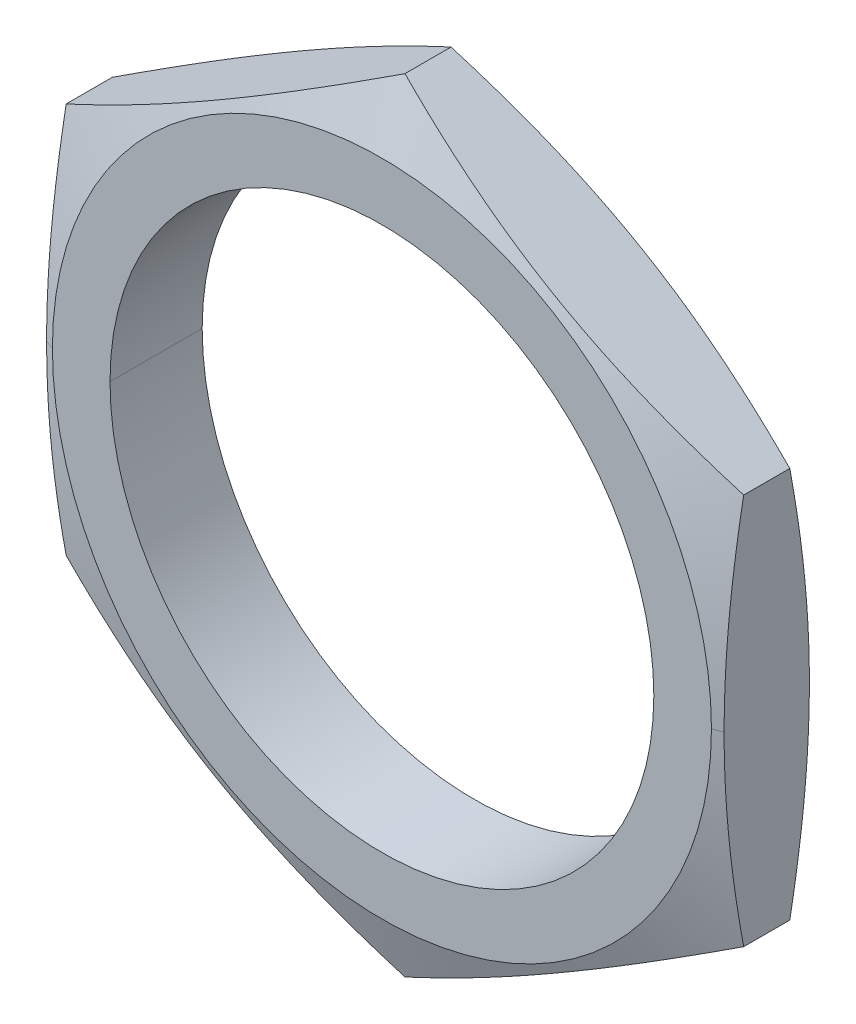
ISO-10303-21;
HEADER;
FILE_DESCRIPTION(('STEP AP214'),'2;1');
FILE_NAME('part.step','',(''),(''),'','','');
FILE_SCHEMA(('AUTOMOTIVE_DESIGN { 1 0 10303 214 1 1 1 1 }'));
ENDSEC;
DATA;
#1=APPLICATION_CONTEXT('core data for automotive mechanical design processes');
#2=APPLICATION_PROTOCOL_DEFINITION('international standard','automotive_design',2000,#1);
#3=PRODUCT_CONTEXT('',#1,'mechanical');
#4=PRODUCT('Part','Part','',(#3));
#5=PRODUCT_RELATED_PRODUCT_CATEGORY('part','',(#4));
#6=PRODUCT_DEFINITION_FORMATION('','',#4);
#7=PRODUCT_DEFINITION_CONTEXT('part definition',#1,'design');
#8=PRODUCT_DEFINITION('design','',#6,#7);
#9=PRODUCT_DEFINITION_SHAPE('','',#8);
#10=(LENGTH_UNIT() NAMED_UNIT(*) SI_UNIT(.MILLI.,.METRE.));
#11=(NAMED_UNIT(*) PLANE_ANGLE_UNIT() SI_UNIT($,.RADIAN.));
#12=(NAMED_UNIT(*) SI_UNIT($,.STERADIAN.) SOLID_ANGLE_UNIT());
#13=UNCERTAINTY_MEASURE_WITH_UNIT(LENGTH_MEASURE(1.E-05),#10,'distance_accuracy_value','');
#14=(GEOMETRIC_REPRESENTATION_CONTEXT(3) GLOBAL_UNCERTAINTY_ASSIGNED_CONTEXT((#13)) GLOBAL_UNIT_ASSIGNED_CONTEXT((#10,
#11,#12)) REPRESENTATION_CONTEXT('',''));
#15=CARTESIAN_POINT('',(0.,0.,0.));
#16=DIRECTION('',(0.,0.,1.));
#17=DIRECTION('',(1.,0.,0.));
#18=AXIS2_PLACEMENT_3D('',#15,#16,#17);
#19=CARTESIAN_POINT('',(7.35,-4.24352447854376,1.));
#20=DIRECTION('',(-1.,0.,0.));
#21=DIRECTION('',(0.,1.,0.));
#22=AXIS2_PLACEMENT_3D('',#19,#20,#21);
#23=PLANE('',#22);
#24=CARTESIAN_POINT('',(7.35,4.24352447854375,-0.500000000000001));
#25=CARTESIAN_POINT('',(7.34999904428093,4.12277718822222,-0.522577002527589));
#26=CARTESIAN_POINT('',(7.34997845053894,4.0018992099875,-0.544463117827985));
#27=CARTESIAN_POINT('',(7.34992599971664,3.76173636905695,-0.586415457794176));
#28=CARTESIAN_POINT('',(7.34989432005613,3.64245547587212,-0.606504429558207));
#29=CARTESIAN_POINT('',(7.34984632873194,3.40523945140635,-0.644864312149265));
#30=CARTESIAN_POINT('',(7.34982981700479,3.28730768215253,-0.66315596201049));
#31=CARTESIAN_POINT('',(7.34982382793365,3.05251976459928,-0.6979234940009));
#32=CARTESIAN_POINT('',(7.34983405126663,2.93566628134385,-0.714417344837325));
#33=CARTESIAN_POINT('',(7.34987849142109,2.70274077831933,-0.7455916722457));
#34=CARTESIAN_POINT('',(7.34991250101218,2.58667068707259,-0.760286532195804));
#35=CARTESIAN_POINT('',(7.34997079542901,2.35499534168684,-0.787869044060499));
#36=CARTESIAN_POINT('',(7.34999513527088,2.23939127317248,-0.800766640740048));
#37=CARTESIAN_POINT('',(7.35000497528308,2.00536865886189,-0.825055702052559));
#38=CARTESIAN_POINT('',(7.34998958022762,1.88694585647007,-0.836406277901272));
#39=CARTESIAN_POINT('',(7.34998262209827,1.65073867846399,-0.857071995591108));
#40=CARTESIAN_POINT('',(7.34999089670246,1.53295547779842,-0.866400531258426));
#41=CARTESIAN_POINT('',(7.35002070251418,1.29757402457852,-0.88303097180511));
#42=CARTESIAN_POINT('',(7.35004219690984,1.17997616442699,-0.890338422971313));
#43=CARTESIAN_POINT('',(7.35003849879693,0.944067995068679,-0.902959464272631));
#44=CARTESIAN_POINT('',(7.35001306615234,0.82575712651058,-0.908262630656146));
#45=CARTESIAN_POINT('',(7.34998229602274,0.589582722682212,-0.916734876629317));
#46=CARTESIAN_POINT('',(7.34997687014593,0.471719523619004,-0.919913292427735));
#47=CARTESIAN_POINT('',(7.34997970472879,0.235904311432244,-0.924154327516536));
#48=CARTESIAN_POINT('',(7.34998797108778,0.11795228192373,-0.925216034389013));
#49=CARTESIAN_POINT('',(7.35,0.,-0.92520842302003));
#50=B_SPLINE_CURVE_WITH_KNOTS('',3,(#24,#25,#26,#27,#28,#29,#30,#31,#32,#33,#34,#35,#36,#37,#38,
#39,#40,#41,#42,#43,#44,#45,#46,#47,#48,#49),.UNSPECIFIED.,.F.,.F.,(4,2,2,2,2,2,2,2,2,2,2,2,4),
(0.,0.368519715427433,0.731392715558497,1.08940769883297,1.44343158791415,1.79440896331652,
2.14335982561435,2.50024081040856,2.85468025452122,3.20813716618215,3.56340781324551,
3.91710694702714,4.27095851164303),.UNSPECIFIED.);
#51=CARTESIAN_POINT('',(7.35,4.24352447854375,-0.5));
#52=VERTEX_POINT('',#51);
#53=CARTESIAN_POINT('',(7.35,0.,-0.925208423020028));
#54=VERTEX_POINT('',#53);
#55=EDGE_CURVE('E363',#52,#54,#50,.T.);
#56=ORIENTED_EDGE('',*,*,#55,.F.);
#57=DIRECTION('',(0.,0.,-1.));
#58=VECTOR('',#57,1.);
#59=CARTESIAN_POINT('',(7.35,4.24352447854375,1.));
#60=LINE('',#59,#58);
#61=CARTESIAN_POINT('',(7.35,4.24352447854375,0.5));
#62=VERTEX_POINT('',#61);
#63=EDGE_CURVE('E10',#62,#52,#60,.T.);
#64=ORIENTED_EDGE('',*,*,#63,.F.);
#65=CARTESIAN_POINT('',(7.34999999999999,0.,0.925208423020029));
#66=CARTESIAN_POINT('',(7.34998775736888,0.117944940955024,0.925216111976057));
#67=CARTESIAN_POINT('',(7.34998012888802,0.235889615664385,0.924154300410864));
#68=CARTESIAN_POINT('',(7.34997856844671,0.471697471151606,0.919913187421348));
#69=CARTESIAN_POINT('',(7.34998463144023,0.589560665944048,0.916734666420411));
#70=CARTESIAN_POINT('',(7.35001497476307,0.82574242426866,0.908262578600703));
#71=CARTESIAN_POINT('',(7.35003933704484,0.944060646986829,0.902959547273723));
#72=CARTESIAN_POINT('',(7.35004136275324,1.17996156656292,0.890339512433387));
#73=CARTESIAN_POINT('',(7.35001927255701,1.29754484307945,0.88303331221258));
#74=CARTESIAN_POINT('',(7.34999018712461,1.53291157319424,0.866404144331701));
#75=CARTESIAN_POINT('',(7.34998323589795,1.6506946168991,0.857075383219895));
#76=CARTESIAN_POINT('',(7.34999105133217,1.88691639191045,0.836408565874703));
#77=CARTESIAN_POINT('',(7.35000597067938,2.00535392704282,0.825056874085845));
#78=CARTESIAN_POINT('',(7.34999416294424,2.23938682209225,0.800767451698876));
#79=CARTESIAN_POINT('',(7.34996836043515,2.35498646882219,0.78787090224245));
#80=CARTESIAN_POINT('',(7.3499084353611,2.5866545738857,0.760289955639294));
#81=CARTESIAN_POINT('',(7.34987426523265,2.70272184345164,0.745595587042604));
#82=CARTESIAN_POINT('',(7.34982988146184,2.93564345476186,0.714421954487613));
#83=CARTESIAN_POINT('',(7.34981987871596,3.05249586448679,0.697928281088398));
#84=CARTESIAN_POINT('',(7.349826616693,3.28728349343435,0.663160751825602));
#85=CARTESIAN_POINT('',(7.34984366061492,3.40521604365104,0.644868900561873));
#86=CARTESIAN_POINT('',(7.34989271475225,3.64243559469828,0.606508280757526));
#87=CARTESIAN_POINT('',(7.34992492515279,3.76171922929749,0.58641874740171));
#88=CARTESIAN_POINT('',(7.34997818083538,4.00188961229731,0.544464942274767));
#89=CARTESIAN_POINT('',(7.34999904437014,4.12277238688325,0.522577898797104));
#90=CARTESIAN_POINT('',(7.35,4.24352447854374,0.5));
#91=B_SPLINE_CURVE_WITH_KNOTS('',3,(#65,#66,#67,#68,#69,#70,#71,#72,#73,#74,#75,#76,#77,#78,#79,
#80,#81,#82,#83,#84,#85,#86,#87,#88,#89,#90),.UNSPECIFIED.,.F.,.F.,(4,2,2,2,2,2,2,2,2,2,2,2,4),
(0.,0.353829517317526,0.707528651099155,1.06282132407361,1.41623433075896,1.77067335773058,
2.12759866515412,2.47653599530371,2.82750478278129,3.18152540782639,3.53954279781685,
3.90242418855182,4.270958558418),.UNSPECIFIED.);
#92=CARTESIAN_POINT('',(7.35,0.,0.925208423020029));
#93=VERTEX_POINT('',#92);
#94=EDGE_CURVE('E246',#93,#62,#91,.T.);
#95=ORIENTED_EDGE('',*,*,#94,.F.);
#96=CARTESIAN_POINT('',(7.34999999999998,-4.24352447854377,0.5));
#97=CARTESIAN_POINT('',(7.34999904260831,-4.12272178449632,0.522587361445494));
#98=CARTESIAN_POINT('',(7.3499784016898,-4.00178828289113,0.544483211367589));
#99=CARTESIAN_POINT('',(7.34992583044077,-3.76151596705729,0.586453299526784));
#100=CARTESIAN_POINT('',(7.34989407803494,-3.64218112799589,0.606550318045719));
#101=CARTESIAN_POINT('',(7.34984597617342,-3.40485841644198,0.644924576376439));
#102=CARTESIAN_POINT('',(7.34982942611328,-3.2868739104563,0.663222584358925));
#103=CARTESIAN_POINT('',(7.34982342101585,-3.05198131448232,0.698001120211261));
#104=CARTESIAN_POINT('',(7.34983366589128,-2.93507589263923,0.714499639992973));
#105=CARTESIAN_POINT('',(7.34987820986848,-2.70204685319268,0.745681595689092));
#106=CARTESIAN_POINT('',(7.34991230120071,-2.58592516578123,0.760379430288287));
#107=CARTESIAN_POINT('',(7.34997071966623,-2.35414647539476,0.787966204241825));
#108=CARTESIAN_POINT('',(7.3499951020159,-2.23849065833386,0.800865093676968));
#109=CARTESIAN_POINT('',(7.35000500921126,-2.00436520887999,0.825154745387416));
#110=CARTESIAN_POINT('',(7.34998963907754,-1.88589132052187,0.836504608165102));
#111=CARTESIAN_POINT('',(7.34998285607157,-1.64958153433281,0.857167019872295));
#112=CARTESIAN_POINT('',(7.34999128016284,-1.53174681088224,0.866492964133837));
#113=CARTESIAN_POINT('',(7.35002132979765,-1.29626117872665,0.883116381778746));
#114=CARTESIAN_POINT('',(7.35004291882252,-1.17861066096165,0.890419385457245));
#115=CARTESIAN_POINT('',(7.35003924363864,-0.942807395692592,0.903018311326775));
#116=CARTESIAN_POINT('',(7.35001382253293,-0.824654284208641,0.908307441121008));
#117=CARTESIAN_POINT('',(7.34998292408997,-0.588794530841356,0.916757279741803));
#118=CARTESIAN_POINT('',(7.34997735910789,-0.471088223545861,0.919927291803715));
#119=CARTESIAN_POINT('',(7.34997991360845,-0.235588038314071,0.924157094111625));
#120=CARTESIAN_POINT('',(7.34998803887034,-0.11779414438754,0.925215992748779));
#121=CARTESIAN_POINT('',(7.34999999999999,0.,0.925208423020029));
#122=B_SPLINE_CURVE_WITH_KNOTS('',3,(#96,#97,#98,#99,#100,#101,#102,#103,#104,#105,#106,#107,
#108,#109,#110,#111,#112,#113,#114,#115,#116,#117,#118,#119,#120,#121),.UNSPECIFIED.,.F.,.F.,(4,
2,2,2,2,2,2,2,2,2,2,2,4),(0.,0.368688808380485,0.731725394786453,1.08989962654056,
1.44407974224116,1.79521178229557,2.1443173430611,2.50135065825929,2.85594355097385,
3.2095572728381,3.56435331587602,3.91758134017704,4.27095851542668),.UNSPECIFIED.);
#123=CARTESIAN_POINT('',(7.35,-4.24352447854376,0.5));
#124=VERTEX_POINT('',#123);
#125=EDGE_CURVE('E366',#124,#93,#122,.T.);
#126=ORIENTED_EDGE('',*,*,#125,.F.);
#127=DIRECTION('',(0.,0.,-1.));
#128=VECTOR('',#127,1.);
#129=CARTESIAN_POINT('',(7.35,-4.24352447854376,1.));
#130=LINE('',#129,#128);
#131=CARTESIAN_POINT('',(7.35,-4.24352447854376,-0.5));
#132=VERTEX_POINT('',#131);
#133=EDGE_CURVE('E337',#124,#132,#130,.T.);
#134=ORIENTED_EDGE('',*,*,#133,.T.);
#135=CARTESIAN_POINT('',(7.35,0.,-0.92520842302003));
#136=CARTESIAN_POINT('',(7.34998782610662,-0.11778682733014,-0.92521606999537));
#137=CARTESIAN_POINT('',(7.34998033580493,-0.235573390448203,-0.924157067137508));
#138=CARTESIAN_POINT('',(7.34997904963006,-0.471066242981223,-0.919927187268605));
#139=CARTESIAN_POINT('',(7.34998524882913,-0.588772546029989,-0.916757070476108));
#140=CARTESIAN_POINT('',(7.35001572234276,-0.824639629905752,-0.908307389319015));
#141=CARTESIAN_POINT('',(7.35004007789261,-0.942800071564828,-0.903018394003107));
#142=CARTESIAN_POINT('',(7.35004208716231,-1.1785960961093,-0.890420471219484));
#143=CARTESIAN_POINT('',(7.35001990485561,-1.29623206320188,-0.883118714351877));
#144=CARTESIAN_POINT('',(7.34999057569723,-1.53170300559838,-0.866496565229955));
#145=CARTESIAN_POINT('',(7.34998347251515,-1.64953757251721,-0.85717039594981));
#146=CARTESIAN_POINT('',(7.34999110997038,-1.8858619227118,-0.836506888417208));
#147=CARTESIAN_POINT('',(7.35000600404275,-2.00435051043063,-0.825155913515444));
#148=CARTESIAN_POINT('',(7.34999413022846,-2.23848621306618,-0.800865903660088));
#149=CARTESIAN_POINT('',(7.34996828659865,-2.35413761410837,-0.787968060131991));
#150=CARTESIAN_POINT('',(7.34990823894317,-2.58590907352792,-0.760382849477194));
#151=CARTESIAN_POINT('',(7.34987398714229,-2.70202794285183,-0.745685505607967));
#152=CARTESIAN_POINT('',(7.34982949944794,-2.93505309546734,-0.714504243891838));
#153=CARTESIAN_POINT('',(7.34981947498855,-3.05195744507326,-0.698005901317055));
#154=CARTESIAN_POINT('',(7.34982622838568,-3.28684975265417,-0.663227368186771));
#155=CARTESIAN_POINT('',(7.3498433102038,-3.40483503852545,-0.644929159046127));
#156=CARTESIAN_POINT('',(7.34989247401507,-3.6421612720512,-0.606554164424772));
#157=CARTESIAN_POINT('',(7.34992475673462,-3.76149884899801,-0.586456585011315));
#158=CARTESIAN_POINT('',(7.3499781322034,-4.00177869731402,-0.5444850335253));
#159=CARTESIAN_POINT('',(7.34999904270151,-4.12271698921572,-0.522588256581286));
#160=CARTESIAN_POINT('',(7.35000000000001,-4.24352447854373,-0.5));
#161=B_SPLINE_CURVE_WITH_KNOTS('',3,(#135,#136,#137,#138,#139,#140,#141,#142,#143,#144,#145,
#146,#147,#148,#149,#150,#151,#152,#153,#154,#155,#156,#157,#158,#159,#160),.UNSPECIFIED.,.F.,
.F.,(4,2,2,2,2,2,2,2,2,2,2,2,4),(0.,0.353355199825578,0.706583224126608,1.06140122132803,
1.41497113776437,1.76956361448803,2.12664115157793,2.47573319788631,2.82685666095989,
3.18103351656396,3.53921015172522,3.90225511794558,4.27095856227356),.UNSPECIFIED.);
#162=EDGE_CURVE('E354',#54,#132,#161,.T.);
#163=ORIENTED_EDGE('',*,*,#162,.F.);
#164=EDGE_LOOP('',(#56,#64,#95,#126,#134,#163));
#165=FACE_BOUND('',#164,.T.);
#166=ADVANCED_FACE('F15',(#165),#23,.F.);
#167=CARTESIAN_POINT('',(7.35,4.24352447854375,1.));
#168=DIRECTION('',(-0.5,-0.866025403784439,0.));
#169=DIRECTION('',(-0.866025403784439,0.5,0.));
#170=AXIS2_PLACEMENT_3D('',#167,#168,#169);
#171=PLANE('',#170);
#172=CARTESIAN_POINT('',(0.,8.4870489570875,-0.500000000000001));
#173=CARTESIAN_POINT('',(0.10466709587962,8.42661827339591,-0.522598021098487));
#174=CARTESIAN_POINT('',(0.209437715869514,8.36610503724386,-0.54450388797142));
#175=CARTESIAN_POINT('',(0.41759085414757,8.24586691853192,-0.586492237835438));
#176=CARTESIAN_POINT('',(0.520970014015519,8.18614418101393,-0.606597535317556));
#177=CARTESIAN_POINT('',(0.726568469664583,8.06738618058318,-0.644986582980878));
#178=CARTESIAN_POINT('',(0.828784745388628,8.00835242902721,-0.663291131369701));
#179=CARTESIAN_POINT('',(1.032297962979,7.89084706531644,-0.698080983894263));
#180=CARTESIAN_POINT('',(1.13359244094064,7.83237652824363,-0.714584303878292));
#181=CARTESIAN_POINT('',(1.33551608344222,7.71584741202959,-0.745774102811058));
#182=CARTESIAN_POINT('',(1.43614347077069,7.65778961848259,-0.760474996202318));
#183=CARTESIAN_POINT('',(1.63699106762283,7.54189782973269,-0.788066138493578));
#184=CARTESIAN_POINT('',(1.73721027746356,7.4840644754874,-0.800966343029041));
#185=CARTESIAN_POINT('',(1.93992703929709,7.367037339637,-0.825240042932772));
#186=CARTESIAN_POINT('',(2.04242762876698,7.30784083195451,-0.83657514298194));
#187=CARTESIAN_POINT('',(2.24688922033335,7.18978699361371,-0.85721159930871));
#188=CARTESIAN_POINT('',(2.34884912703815,7.13093010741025,-0.866526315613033));
#189=CARTESIAN_POINT('',(2.55261614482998,7.0133194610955,-0.883131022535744));
#190=CARTESIAN_POINT('',(2.6544229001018,6.95456586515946,-0.890426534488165));
#191=CARTESIAN_POINT('',(2.8585353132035,6.83671795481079,-0.903018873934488));
#192=CARTESIAN_POINT('',(2.96084127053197,6.777623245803,-0.908307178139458));
#193=CARTESIAN_POINT('',(3.16507866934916,6.65966986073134,-0.916757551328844));
#194=CARTESIAN_POINT('',(3.26700978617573,6.60081128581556,-0.919928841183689));
#195=CARTESIAN_POINT('',(3.47096336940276,6.48306886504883,-0.924154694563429));
#196=CARTESIAN_POINT('',(3.57298585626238,6.42418501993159,-0.925208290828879));
#197=CARTESIAN_POINT('',(3.77700150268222,6.30639571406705,-0.925208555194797));
#198=CARTESIAN_POINT('',(3.87899466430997,6.2474902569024,-0.924155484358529));
#199=CARTESIAN_POINT('',(4.08292705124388,6.12974040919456,-0.919930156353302));
#200=CARTESIAN_POINT('',(4.18486628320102,6.07089600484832,-0.916758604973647));
#201=CARTESIAN_POINT('',(4.38914860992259,5.95299123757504,-0.908307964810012));
#202=CARTESIAN_POINT('',(4.491491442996,5.89393110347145,-0.903019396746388));
#203=CARTESIAN_POINT('',(4.69560632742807,5.7760872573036,-0.890427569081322));
#204=CARTESIAN_POINT('',(4.79737889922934,5.71730347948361,-0.883133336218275));
#205=CARTESIAN_POINT('',(5.0011038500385,5.59964927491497,-0.866529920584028));
#206=CARTESIAN_POINT('',(5.10305589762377,5.54077908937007,-0.85721497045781));
#207=CARTESIAN_POINT('',(5.30753733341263,5.42273056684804,-0.836577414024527));
#208=CARTESIAN_POINT('',(5.4100657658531,5.36355295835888,-0.825241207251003));
#209=CARTESIAN_POINT('',(5.61278049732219,5.24650184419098,-0.800967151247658));
#210=CARTESIAN_POINT('',(5.71297071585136,5.18862707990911,-0.78806798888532));
#211=CARTESIAN_POINT('',(5.91375269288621,5.07263605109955,-0.760478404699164));
#212=CARTESIAN_POINT('',(6.01434339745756,5.01452033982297,-0.74577800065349));
#213=CARTESIAN_POINT('',(6.21621906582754,4.89791587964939,-0.714588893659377));
#214=CARTESIAN_POINT('',(6.31750245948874,4.8394282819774,-0.698085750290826));
#215=CARTESIAN_POINT('',(6.52102182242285,4.72193413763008,-0.663295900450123));
#216=CARTESIAN_POINT('',(6.62325562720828,4.66292919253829,-0.644991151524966));
#217=CARTESIAN_POINT('',(6.82890587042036,4.54425386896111,-0.60660136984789));
#218=CARTESIAN_POINT('',(6.93231948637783,4.48458535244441,-0.586495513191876));
#219=CARTESIAN_POINT('',(7.14053222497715,4.36443544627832,-0.544505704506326));
#220=CARTESIAN_POINT('',(7.24532780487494,4.30395589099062,-0.522598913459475));
#221=CARTESIAN_POINT('',(7.35,4.24352447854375,-0.500000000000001));
#222=B_SPLINE_CURVE_WITH_KNOTS('',3,(#172,#173,#174,#175,#176,#177,#178,#179,#180,#181,#182,
#183,#184,#185,#186,#187,#188,#189,#190,#191,#192,#193,#194,#195,#196,#197,#198,#199,#200,#201,
#202,#203,#204,#205,#206,#207,#208,#209,#210,#211,#212,#213,#214,#215,#216,#217,#218,#219,#220,
#221),.UNSPECIFIED.,.F.,.F.,(4,2,2,2,2,2,2,2,2,2,2,2,2,2,2,2,2,2,2,2,2,2,2,2,4),(0.,
0.368862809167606,0.732067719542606,1.09040580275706,1.44474665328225,1.79603781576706,
2.14530253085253,2.50201057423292,2.85628261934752,3.20957614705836,3.56435352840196,
3.91757537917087,4.27095852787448,4.62429788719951,4.97751958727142,5.3323409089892,
5.68559073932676,6.03986236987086,6.3966145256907,6.7458657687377,7.09714838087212,
7.45148598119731,7.80982646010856,8.17303972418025,8.54191712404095),.UNSPECIFIED.);
#223=CARTESIAN_POINT('',(0.,8.4870489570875,-0.5));
#224=VERTEX_POINT('',#223);
#225=EDGE_CURVE('E158',#224,#52,#222,.T.);
#226=ORIENTED_EDGE('',*,*,#225,.F.);
#227=DIRECTION('',(0.,0.,-1.));
#228=VECTOR('',#227,1.);
#229=CARTESIAN_POINT('',(0.,8.4870489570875,1.));
#230=LINE('',#229,#228);
#231=CARTESIAN_POINT('',(0.,8.4870489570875,0.5));
#232=VERTEX_POINT('',#231);
#233=EDGE_CURVE('E29',#232,#224,#230,.T.);
#234=ORIENTED_EDGE('',*,*,#233,.F.);
#235=CARTESIAN_POINT('',(7.35,4.24352447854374,0.5));
#236=CARTESIAN_POINT('',(7.24533194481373,4.30395350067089,0.522598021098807));
#237=CARTESIAN_POINT('',(7.14054063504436,4.36443090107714,0.544503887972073));
#238=CARTESIAN_POINT('',(6.93233480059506,4.48457774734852,0.586492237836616));
#239=CARTESIAN_POINT('',(6.82892381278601,4.54424535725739,0.606597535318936));
#240=CARTESIAN_POINT('',(6.62327713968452,4.66291984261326,0.644986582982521));
#241=CARTESIAN_POINT('',(6.52104427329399,4.72192485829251,0.663291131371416));
#242=CARTESIAN_POINT('',(6.3175250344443,4.839419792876,0.698080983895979));
#243=CARTESIAN_POINT('',(6.2162408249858,4.89790811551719,0.714584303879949));
#244=CARTESIAN_POINT('',(6.01436182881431,5.01451456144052,0.745774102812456));
#245=CARTESIAN_POINT('',(5.91376861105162,5.07263153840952,0.760474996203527));
#246=CARTESIAN_POINT('',(5.71297957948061,5.1886247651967,0.78806613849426));
#247=CARTESIAN_POINT('',(5.61278482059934,5.24650046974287,0.800966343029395));
#248=CARTESIAN_POINT('',(5.41007796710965,5.36354476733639,0.825240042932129));
#249=CARTESIAN_POINT('',(5.30756199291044,5.42271462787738,0.83657514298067));
#250=CARTESIAN_POINT('',(5.10309357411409,5.54075664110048,0.857211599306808));
#251=CARTESIAN_POINT('',(5.00114206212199,5.599628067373,0.866526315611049));
#252=CARTESIAN_POINT('',(4.7974047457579,5.71729015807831,0.883131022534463));
#253=CARTESIAN_POINT('',(4.69561926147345,5.77608059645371,0.890426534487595));
#254=CARTESIAN_POINT('',(4.49150377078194,5.89392317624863,0.903018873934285));
#255=CARTESIAN_POINT('',(4.38917327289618,5.95297537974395,0.90830717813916));
#256=CARTESIAN_POINT('',(4.18490394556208,6.07087346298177,0.916757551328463));
#257=CARTESIAN_POINT('',(4.08296536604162,6.12971911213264,0.919928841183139));
#258=CARTESIAN_POINT('',(3.87902064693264,6.24747688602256,0.924154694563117));
#259=CARTESIAN_POINT('',(3.77701449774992,6.30638902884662,0.925208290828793));
#260=CARTESIAN_POINT('',(3.57299814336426,6.4241771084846,0.92520855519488));
#261=CARTESIAN_POINT('',(3.4709879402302,6.48305304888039,0.924155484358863));
#262=CARTESIAN_POINT('',(3.26704738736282,6.6007887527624,0.919930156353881));
#263=CARTESIAN_POINT('',(3.16511702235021,6.65964851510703,0.916758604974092));
#264=CARTESIAN_POINT('',(2.96086733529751,6.77760981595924,0.908307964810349));
#265=CARTESIAN_POINT('',(2.85854834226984,6.83671124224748,0.903019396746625));
#266=CARTESIAN_POINT('',(2.6544351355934,6.95455799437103,0.890427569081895));
#267=CARTESIAN_POINT('',(2.5526406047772,7.01330373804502,0.883133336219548));
#268=CARTESIAN_POINT('',(2.34888659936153,7.13090761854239,0.86652992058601));
#269=CARTESIAN_POINT('',(2.24692749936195,7.18976558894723,0.857214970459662));
#270=CARTESIAN_POINT('',(2.04245376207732,7.30782744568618,0.836577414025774));
#271=CARTESIAN_POINT('',(1.93994023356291,7.36703086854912,0.825241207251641));
#272=CARTESIAN_POINT('',(1.73721362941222,7.4840614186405,0.800967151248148));
#273=CARTESIAN_POINT('',(1.63699750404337,7.54189131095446,0.78806798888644));
#274=CARTESIAN_POINT('',(1.43615533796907,7.65777808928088,0.760478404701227));
#275=CARTESIAN_POINT('',(1.3355303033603,7.71583433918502,0.74577800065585));
#276=CARTESIAN_POINT('',(1.13361004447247,7.83236156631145,0.714588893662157));
#277=CARTESIAN_POINT('',(1.03231660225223,7.89083175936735,0.698085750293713));
#278=CARTESIAN_POINT('',(0.828804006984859,8.00833762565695,0.663295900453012));
#279=CARTESIAN_POINT('',(0.7265873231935,8.06737222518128,0.644991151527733));
#280=CARTESIAN_POINT('',(0.520986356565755,8.18613289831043,0.606601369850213));
#281=CARTESIAN_POINT('',(0.417605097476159,8.24585745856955,0.58649551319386));
#282=CARTESIAN_POINT('',(0.209445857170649,8.36610002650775,0.544505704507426));
#283=CARTESIAN_POINT('',(0.10467123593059,8.42661588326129,0.522598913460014));
#284=CARTESIAN_POINT('',(0.,8.48704895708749,0.5));
#285=B_SPLINE_CURVE_WITH_KNOTS('',3,(#235,#236,#237,#238,#239,#240,#241,#242,#243,#244,#245,
#246,#247,#248,#249,#250,#251,#252,#253,#254,#255,#256,#257,#258,#259,#260,#261,#262,#263,#264,
#265,#266,#267,#268,#269,#270,#271,#272,#273,#274,#275,#276,#277,#278,#279,#280,#281,#282,#283,
#284),.UNSPECIFIED.,.F.,.F.,(4,2,2,2,2,2,2,2,2,2,2,2,2,2,2,2,2,2,2,2,2,2,2,2,4),(0.,
0.368862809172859,0.732067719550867,1.09040580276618,1.4447466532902,1.79603781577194,
2.14530253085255,2.50201057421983,2.85628261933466,3.20957614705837,3.56435352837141,
3.91757537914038,4.27095852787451,4.62429788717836,4.97751958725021,5.33234090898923,
5.68559073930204,6.03986236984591,6.39661452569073,6.74586576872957,7.0971483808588,
7.45148598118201,7.80982646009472,8.17303972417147,8.54191712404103),.UNSPECIFIED.);
#286=EDGE_CURVE('E522',#62,#232,#285,.T.);
#287=ORIENTED_EDGE('',*,*,#286,.F.);
#288=ORIENTED_EDGE('',*,*,#63,.T.);
#289=EDGE_LOOP('',(#226,#234,#287,#288));
#290=FACE_BOUND('',#289,.T.);
#291=ADVANCED_FACE('F211',(#290),#171,.F.);
#292=CARTESIAN_POINT('',(0.,8.4870489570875,1.));
#293=DIRECTION('',(0.5,-0.866025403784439,0.));
#294=DIRECTION('',(0.,0.,-1.));
#295=AXIS2_PLACEMENT_3D('',#292,#293,#294);
#296=PLANE('',#295);
#297=CARTESIAN_POINT('',(-7.35,4.24352447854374,-0.500000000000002));
#298=CARTESIAN_POINT('',(-7.24533194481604,4.30395350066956,-0.522598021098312));
#299=CARTESIAN_POINT('',(-7.14054063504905,4.36443090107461,-0.544503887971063));
#300=CARTESIAN_POINT('',(-6.93233480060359,4.48457774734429,-0.586492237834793));
#301=CARTESIAN_POINT('',(-6.828923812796,4.54424535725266,-0.606597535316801));
#302=CARTESIAN_POINT('',(-6.6232771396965,4.66291984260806,-0.644986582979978));
#303=CARTESIAN_POINT('',(-6.52104427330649,4.72192485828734,-0.663291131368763));
#304=CARTESIAN_POINT('',(-6.31752503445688,4.83941979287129,-0.698080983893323));
#305=CARTESIAN_POINT('',(-6.21624082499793,4.89790811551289,-0.714584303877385));
#306=CARTESIAN_POINT('',(-6.01436182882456,5.0145145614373,-0.745774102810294));
#307=CARTESIAN_POINT('',(-5.91376861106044,5.07263153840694,-0.76047499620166));
#308=CARTESIAN_POINT('',(-5.71297957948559,5.18862476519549,-0.788066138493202));
#309=CARTESIAN_POINT('',(-5.61278482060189,5.24650046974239,-0.800966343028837));
#310=CARTESIAN_POINT('',(-5.41007796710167,5.36354476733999,-0.825240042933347));
#311=CARTESIAN_POINT('',(-5.30756199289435,5.42271462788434,-0.83657514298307));
#312=CARTESIAN_POINT('',(-5.10309357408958,5.54075664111,-0.857211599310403));
#313=CARTESIAN_POINT('',(-5.00114206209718,5.59962806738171,-0.866526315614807));
#314=CARTESIAN_POINT('',(-4.79740474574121,5.7172901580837,-0.883131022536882));
#315=CARTESIAN_POINT('',(-4.69561926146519,5.77608059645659,-0.89042653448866));
#316=CARTESIAN_POINT('',(-4.49150377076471,5.89392317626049,-0.903018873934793));
#317=CARTESIAN_POINT('',(-4.3891732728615,5.9529753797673,-0.908307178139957));
#318=CARTESIAN_POINT('',(-4.18490394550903,6.07087346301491,-0.916757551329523));
#319=CARTESIAN_POINT('',(-4.08296536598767,6.12971911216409,-0.91992884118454));
#320=CARTESIAN_POINT('',(-3.87902064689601,6.24747688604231,-0.924154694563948));
#321=CARTESIAN_POINT('',(-3.77701449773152,6.30638902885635,-0.925208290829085));
#322=CARTESIAN_POINT('',(-3.57299814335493,6.42417710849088,-0.925208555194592));
#323=CARTESIAN_POINT('',(-3.47098794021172,6.48305304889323,-0.924155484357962));
#324=CARTESIAN_POINT('',(-3.26704738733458,6.60078875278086,-0.919930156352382));
#325=CARTESIAN_POINT('',(-3.16511702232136,6.65964851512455,-0.916758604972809));
#326=CARTESIAN_POINT('',(-2.96086733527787,6.77760981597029,-0.908307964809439));
#327=CARTESIAN_POINT('',(-2.85854834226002,6.836711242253,-0.903019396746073));
#328=CARTESIAN_POINT('',(-2.654435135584,6.95455799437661,-0.890427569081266));
#329=CARTESIAN_POINT('',(-2.5526406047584,7.01330373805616,-0.883133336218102));
#330=CARTESIAN_POINT('',(-2.34888659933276,7.13090761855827,-0.866529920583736));
#331=CARTESIAN_POINT('',(-2.24692749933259,7.18976558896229,-0.857214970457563));
#332=CARTESIAN_POINT('',(-2.04245376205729,7.30782744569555,-0.836577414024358));
#333=CARTESIAN_POINT('',(-1.93994023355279,7.36703086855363,-0.825241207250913));
#334=CARTESIAN_POINT('',(-1.7372136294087,7.48406141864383,-0.800967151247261));
#335=CARTESIAN_POINT('',(-1.63699750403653,7.54189131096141,-0.788067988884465));
#336=CARTESIAN_POINT('',(-1.43615533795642,7.65777808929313,-0.760478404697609));
#337=CARTESIAN_POINT('',(-1.33553030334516,7.71583433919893,-0.745778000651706));
#338=CARTESIAN_POINT('',(-1.13361004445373,7.83236156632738,-0.714588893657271));
#339=CARTESIAN_POINT('',(-1.03231660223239,7.89083175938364,-0.69808575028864));
#340=CARTESIAN_POINT('',(-0.828804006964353,8.00833762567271,-0.663295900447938));
#341=CARTESIAN_POINT('',(-0.726587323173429,8.06737222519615,-0.644991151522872));
#342=CARTESIAN_POINT('',(-0.520986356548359,8.18613289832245,-0.606601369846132));
#343=CARTESIAN_POINT('',(-0.417605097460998,8.24585745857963,-0.586495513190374));
#344=CARTESIAN_POINT('',(-0.209445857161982,8.36610002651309,-0.544505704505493));
#345=CARTESIAN_POINT('',(-0.104671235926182,8.42661588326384,-0.522598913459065));
#346=CARTESIAN_POINT('',(0.,8.4870489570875,-0.500000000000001));
#347=B_SPLINE_CURVE_WITH_KNOTS('',3,(#297,#298,#299,#300,#301,#302,#303,#304,#305,#306,#307,
#308,#309,#310,#311,#312,#313,#314,#315,#316,#317,#318,#319,#320,#321,#322,#323,#324,#325,#326,
#327,#328,#329,#330,#331,#332,#333,#334,#335,#336,#337,#338,#339,#340,#341,#342,#343,#344,#345,
#346),.UNSPECIFIED.,.F.,.F.,(4,2,2,2,2,2,2,2,2,2,2,2,2,2,2,2,2,2,2,2,2,2,2,2,4),(0.,
0.368862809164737,0.732067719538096,1.09040580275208,1.44474665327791,1.7960378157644,
2.14530253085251,2.50201057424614,2.85628261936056,3.20957614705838,3.56435352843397,
3.91757537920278,4.2709585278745,4.624297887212,4.97751958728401,5.33234090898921,
5.68559073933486,6.03986236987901,6.39661452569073,6.7458657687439,7.09714838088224,
7.45148598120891,7.80982646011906,8.17303972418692,8.54191712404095),.UNSPECIFIED.);
#348=CARTESIAN_POINT('',(-7.35,4.24352447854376,-0.5));
#349=VERTEX_POINT('',#348);
#350=EDGE_CURVE('E150',#349,#224,#347,.T.);
#351=ORIENTED_EDGE('',*,*,#350,.F.);
#352=DIRECTION('',(0.,0.,-1.));
#353=VECTOR('',#352,1.);
#354=CARTESIAN_POINT('',(-7.35,4.24352447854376,1.));
#355=LINE('',#354,#353);
#356=CARTESIAN_POINT('',(-7.35,4.24352447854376,0.5));
#357=VERTEX_POINT('',#356);
#358=EDGE_CURVE('E135',#357,#349,#355,.T.);
#359=ORIENTED_EDGE('',*,*,#358,.F.);
#360=CARTESIAN_POINT('',(0.,8.48704895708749,0.5));
#361=CARTESIAN_POINT('',(-0.104667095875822,8.4266182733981,0.522598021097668));
#362=CARTESIAN_POINT('',(-0.209437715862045,8.36610503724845,0.544503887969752));
#363=CARTESIAN_POINT('',(-0.417590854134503,8.2458669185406,0.586492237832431));
#364=CARTESIAN_POINT('',(-0.520970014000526,8.18614418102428,0.606597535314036));
#365=CARTESIAN_POINT('',(-0.726568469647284,8.06738618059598,0.644986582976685));
#366=CARTESIAN_POINT('',(-0.828784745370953,8.00835242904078,0.663291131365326));
#367=CARTESIAN_POINT('',(-1.0322979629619,7.89084706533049,0.698080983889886));
#368=CARTESIAN_POINT('',(-1.13359244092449,7.83237652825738,0.714584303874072));
#369=CARTESIAN_POINT('',(-1.33551608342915,7.71584741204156,0.745774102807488));
#370=CARTESIAN_POINT('',(-1.43614347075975,7.65778961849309,0.760474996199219));
#371=CARTESIAN_POINT('',(-1.63699106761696,7.54189782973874,0.78806613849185));
#372=CARTESIAN_POINT('',(-1.73721027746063,7.48406447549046,0.800966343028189));
#373=CARTESIAN_POINT('',(-1.93992703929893,7.3670373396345,0.825240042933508));
#374=CARTESIAN_POINT('',(-2.04242762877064,7.30784083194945,0.836575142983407));
#375=CARTESIAN_POINT('',(-2.24688922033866,7.18978699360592,0.857211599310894));
#376=CARTESIAN_POINT('',(-2.34884912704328,7.1309301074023,0.866526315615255));
#377=CARTESIAN_POINT('',(-2.55261614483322,7.01331946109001,0.88313102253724));
#378=CARTESIAN_POINT('',(-2.65442290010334,6.95456586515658,0.890426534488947));
#379=CARTESIAN_POINT('',(-2.8585353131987,6.83671795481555,0.903018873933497));
#380=CARTESIAN_POINT('',(-2.96084127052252,6.77762324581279,0.908307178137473));
#381=CARTESIAN_POINT('',(-3.16507866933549,6.65966986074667,0.916757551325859));
#382=CARTESIAN_POINT('',(-3.26700978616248,6.6008112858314,0.919928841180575));
#383=CARTESIAN_POINT('',(-3.47096336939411,6.48306886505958,0.924154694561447));
#384=CARTESIAN_POINT('',(-3.57298585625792,6.42418501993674,0.925208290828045));
#385=CARTESIAN_POINT('',(-3.77700150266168,6.30639571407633,0.925208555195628));
#386=CARTESIAN_POINT('',(-3.87899466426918,6.24749025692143,0.924155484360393));
#387=CARTESIAN_POINT('',(-4.08292705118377,6.12974040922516,0.91993015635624));
#388=CARTESIAN_POINT('',(-4.18486628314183,6.07089600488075,0.916758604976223));
#389=CARTESIAN_POINT('',(-4.38914860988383,5.95299123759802,0.908307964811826));
#390=CARTESIAN_POINT('',(-4.49149144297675,5.89393110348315,0.903019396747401));
#391=CARTESIAN_POINT('',(-4.69560632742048,5.77608725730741,0.890427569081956));
#392=CARTESIAN_POINT('',(-4.79737889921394,5.71730347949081,0.883133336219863));
#393=CARTESIAN_POINT('',(-5.00110385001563,5.59964927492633,0.866529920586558));
#394=CARTESIAN_POINT('',(-5.10305589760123,5.5407790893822,0.857214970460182));
#395=CARTESIAN_POINT('',(-5.30753733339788,5.42273056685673,0.836577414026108));
#396=CARTESIAN_POINT('',(-5.41006576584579,5.36355295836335,0.82524120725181));
#397=CARTESIAN_POINT('',(-5.61278049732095,5.24650184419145,0.800967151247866));
#398=CARTESIAN_POINT('',(-5.71297071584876,5.18862707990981,0.788067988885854));
#399=CARTESIAN_POINT('',(-5.91375269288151,5.07263605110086,0.760478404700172));
#400=CARTESIAN_POINT('',(-6.01434339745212,5.01452033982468,0.745778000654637));
#401=CARTESIAN_POINT('',(-6.21621906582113,4.89791587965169,0.714588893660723));
#402=CARTESIAN_POINT('',(-6.31750245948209,4.83942828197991,0.698085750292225));
#403=CARTESIAN_POINT('',(-6.52102182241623,4.72193413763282,0.663295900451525));
#404=CARTESIAN_POINT('',(-6.62325562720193,4.66292919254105,0.644991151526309));
#405=CARTESIAN_POINT('',(-6.82890587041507,4.54425386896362,0.606601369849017));
#406=CARTESIAN_POINT('',(-6.93231948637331,4.48458535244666,0.586495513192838));
#407=CARTESIAN_POINT('',(-7.14053222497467,4.36443544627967,0.544505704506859));
#408=CARTESIAN_POINT('',(-7.24532780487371,4.30395589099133,0.522598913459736));
#409=CARTESIAN_POINT('',(-7.34999999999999,4.24352447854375,0.5));
#410=B_SPLINE_CURVE_WITH_KNOTS('',3,(#360,#361,#362,#363,#364,#365,#366,#367,#368,#369,#370,
#371,#372,#373,#374,#375,#376,#377,#378,#379,#380,#381,#382,#383,#384,#385,#386,#387,#388,#389,
#390,#391,#392,#393,#394,#395,#396,#397,#398,#399,#400,#401,#402,#403,#404,#405,#406,#407,#408,
#409),.UNSPECIFIED.,.F.,.F.,(4,2,2,2,2,2,2,2,2,2,2,2,2,2,2,2,2,2,2,2,2,2,2,2,4),(0.,
0.368862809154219,0.732067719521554,1.09040580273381,1.44474665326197,1.79603781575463,
2.14530253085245,2.50201057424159,2.85628261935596,3.20957614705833,3.56435352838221,
3.91757537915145,4.27095852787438,4.62429788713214,4.97751958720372,5.33234090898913,
5.68559073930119,6.03986236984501,6.39661452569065,6.74586576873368,7.09714838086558,
7.4514859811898,7.80982646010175,8.1730397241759,8.54191712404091),.UNSPECIFIED.);
#411=EDGE_CURVE('E516',#232,#357,#410,.T.);
#412=ORIENTED_EDGE('',*,*,#411,.F.);
#413=ORIENTED_EDGE('',*,*,#233,.T.);
#414=EDGE_LOOP('',(#351,#359,#412,#413));
#415=FACE_BOUND('',#414,.T.);
#416=ADVANCED_FACE('F152',(#415),#296,.F.);
#417=CARTESIAN_POINT('',(-7.35,4.24352447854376,1.));
#418=DIRECTION('',(1.,0.,0.));
#419=DIRECTION('',(0.,1.,0.));
#420=AXIS2_PLACEMENT_3D('',#417,#418,#419);
#421=PLANE('',#420);
#422=CARTESIAN_POINT('',(-7.34999999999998,-4.24352447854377,-0.500000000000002));
#423=CARTESIAN_POINT('',(-7.34999904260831,-4.12272178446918,-0.522587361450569));
#424=CARTESIAN_POINT('',(-7.34997840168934,-4.00178828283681,-0.544483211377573));
#425=CARTESIAN_POINT('',(-7.34992583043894,-3.76151596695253,-0.586453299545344));
#426=CARTESIAN_POINT('',(-7.34989407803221,-3.64218112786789,-0.606550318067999));
#427=CARTESIAN_POINT('',(-7.3498459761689,-3.40485841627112,-0.644924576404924));
#428=CARTESIAN_POINT('',(-7.34982942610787,-3.28687391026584,-0.663222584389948));
#429=CARTESIAN_POINT('',(-7.34982342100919,-3.05198131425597,-0.698001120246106));
#430=CARTESIAN_POINT('',(-7.34983366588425,-2.93507589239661,-0.714499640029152));
#431=CARTESIAN_POINT('',(-7.34987820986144,-2.70204685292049,-0.745681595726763));
#432=CARTESIAN_POINT('',(-7.34991230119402,-2.58592516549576,-0.760379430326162));
#433=CARTESIAN_POINT('',(-7.34997071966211,-2.35414647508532,-0.787966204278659));
#434=CARTESIAN_POINT('',(-7.34999510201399,-2.23849065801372,-0.800865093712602));
#435=CARTESIAN_POINT('',(-7.3500050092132,-2.00436520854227,-0.825154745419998));
#436=CARTESIAN_POINT('',(-7.3499896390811,-1.88589132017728,-0.83650460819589));
#437=CARTESIAN_POINT('',(-7.34998285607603,-1.64958153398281,-0.857167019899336));
#438=CARTESIAN_POINT('',(-7.3499912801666,-1.5317468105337,-0.866492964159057));
#439=CARTESIAN_POINT('',(-7.35002132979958,-1.29626117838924,-0.883116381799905));
#440=CARTESIAN_POINT('',(-7.35004291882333,-1.17861066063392,-0.890419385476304));
#441=CARTESIAN_POINT('',(-7.35003924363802,-0.942807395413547,-0.903018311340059));
#442=CARTESIAN_POINT('',(-7.35001382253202,-0.824654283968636,-0.908307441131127));
#443=CARTESIAN_POINT('',(-7.34998292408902,-0.58879453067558,-0.916757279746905));
#444=CARTESIAN_POINT('',(-7.34997735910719,-0.471088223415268,-0.919927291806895));
#445=CARTESIAN_POINT('',(-7.34997991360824,-0.235588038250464,-0.924157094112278));
#446=CARTESIAN_POINT('',(-7.34998803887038,-0.117794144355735,-0.925215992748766));
#447=CARTESIAN_POINT('',(-7.35,0.,-0.92520842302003));
#448=B_SPLINE_CURVE_WITH_KNOTS('',3,(#422,#423,#424,#425,#426,#427,#428,#429,#430,#431,#432,
#433,#434,#435,#436,#437,#438,#439,#440,#441,#442,#443,#444,#445,#446,#447),.UNSPECIFIED.,.F.,
.F.,(4,2,2,2,2,2,2,2,2,2,2,2,4),(0.,0.368688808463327,0.731725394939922,1.0898996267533,
1.4440797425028,1.7952117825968,2.14431734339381,2.50135065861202,2.85594355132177,
3.20955727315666,3.56435331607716,3.91758134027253,4.27095851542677),.UNSPECIFIED.);
#449=CARTESIAN_POINT('',(-7.35,-4.24352447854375,-0.5));
#450=VERTEX_POINT('',#449);
#451=CARTESIAN_POINT('',(-7.35,0.,-0.92520842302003));
#452=VERTEX_POINT('',#451);
#453=EDGE_CURVE('E346',#450,#452,#448,.T.);
#454=ORIENTED_EDGE('',*,*,#453,.F.);
#455=DIRECTION('',(0.,0.,-1.));
#456=VECTOR('',#455,1.);
#457=CARTESIAN_POINT('',(-7.35,-4.24352447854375,1.));
#458=LINE('',#457,#456);
#459=CARTESIAN_POINT('',(-7.35,-4.24352447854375,0.5));
#460=VERTEX_POINT('',#459);
#461=EDGE_CURVE('E44',#460,#450,#458,.T.);
#462=ORIENTED_EDGE('',*,*,#461,.F.);
#463=CARTESIAN_POINT('',(-7.34999999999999,0.,0.925208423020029));
#464=CARTESIAN_POINT('',(-7.34998782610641,-0.117786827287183,0.925216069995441));
#465=CARTESIAN_POINT('',(-7.34998033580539,-0.235573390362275,0.924157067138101));
#466=CARTESIAN_POINT('',(-7.34997904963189,-0.471066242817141,0.919927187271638));
#467=CARTESIAN_POINT('',(-7.34998524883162,-0.588772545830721,0.916757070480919));
#468=CARTESIAN_POINT('',(-7.35001572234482,-0.824639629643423,0.908307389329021));
#469=CARTESIAN_POINT('',(-7.35004007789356,-0.942800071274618,0.903018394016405));
#470=CARTESIAN_POINT('',(-7.35004208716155,-1.17859609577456,0.890420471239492));
#471=CARTESIAN_POINT('',(-7.35001990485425,-1.29623206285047,0.88311871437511));
#472=CARTESIAN_POINT('',(-7.34999057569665,-1.53170300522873,0.866496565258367));
#473=CARTESIAN_POINT('',(-7.34998347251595,-1.64953757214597,0.857170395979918));
#474=CARTESIAN_POINT('',(-7.34999110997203,-1.88586192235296,0.836506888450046));
#475=CARTESIAN_POINT('',(-7.35000600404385,-2.00435051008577,0.825155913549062));
#476=CARTESIAN_POINT('',(-7.34999413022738,-2.23848621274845,0.800865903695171));
#477=CARTESIAN_POINT('',(-7.34996828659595,-2.3541376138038,0.787968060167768));
#478=CARTESIAN_POINT('',(-7.34990823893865,-2.58590907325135,0.760382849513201));
#479=CARTESIAN_POINT('',(-7.34987398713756,-2.7020279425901,0.745685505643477));
#480=CARTESIAN_POINT('',(-7.34982949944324,-2.93505309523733,0.714504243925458));
#481=CARTESIAN_POINT('',(-7.34981947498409,-3.05195744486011,0.698005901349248));
#482=CARTESIAN_POINT('',(-7.34982622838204,-3.28684975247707,0.663227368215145));
#483=CARTESIAN_POINT('',(-7.34984331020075,-3.40483503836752,0.644929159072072));
#484=CARTESIAN_POINT('',(-7.34989247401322,-3.64216127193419,0.606554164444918));
#485=CARTESIAN_POINT('',(-7.34992475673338,-3.76149884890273,0.586456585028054));
#486=CARTESIAN_POINT('',(-7.34997813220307,-4.00177869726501,0.544485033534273));
#487=CARTESIAN_POINT('',(-7.3499990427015,-4.12271698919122,0.522588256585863));
#488=CARTESIAN_POINT('',(-7.35,-4.24352447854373,0.5));
#489=B_SPLINE_CURVE_WITH_KNOTS('',3,(#463,#464,#465,#466,#467,#468,#469,#470,#471,#472,#473,
#474,#475,#476,#477,#478,#479,#480,#481,#482,#483,#484,#485,#486,#487,#488),.UNSPECIFIED.,.F.,
.F.,(4,2,2,2,2,2,2,2,2,2,2,2,4),(0.,0.353355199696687,0.706583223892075,1.06140122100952,
1.41497113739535,1.76956361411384,2.12664115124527,2.47573319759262,2.82685666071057,
3.18103351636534,3.53921015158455,3.9022551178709,4.27095856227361),.UNSPECIFIED.);
#490=CARTESIAN_POINT('',(-7.35,0.,0.92520842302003));
#491=VERTEX_POINT('',#490);
#492=EDGE_CURVE('E416',#491,#460,#489,.T.);
#493=ORIENTED_EDGE('',*,*,#492,.F.);
#494=CARTESIAN_POINT('',(-7.34999999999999,4.24352447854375,0.5));
#495=CARTESIAN_POINT('',(-7.34999904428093,4.12277718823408,0.522577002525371));
#496=CARTESIAN_POINT('',(-7.34997845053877,4.00189921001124,0.544463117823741));
#497=CARTESIAN_POINT('',(-7.34992599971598,3.76173636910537,0.586415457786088));
#498=CARTESIAN_POINT('',(-7.34989432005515,3.64245547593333,0.60650442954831));
#499=CARTESIAN_POINT('',(-7.34984632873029,3.4052394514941,0.644864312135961));
#500=CARTESIAN_POINT('',(-7.34982981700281,3.28730768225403,0.663155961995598));
#501=CARTESIAN_POINT('',(-7.34982382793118,3.05251976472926,0.697923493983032));
#502=CARTESIAN_POINT('',(-7.349834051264,2.93566628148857,0.714417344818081));
#503=CARTESIAN_POINT('',(-7.34987849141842,2.70274077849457,0.745591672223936));
#504=CARTESIAN_POINT('',(-7.34991250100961,2.58667068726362,0.760286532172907));
#505=CARTESIAN_POINT('',(-7.3499707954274,2.35499534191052,0.787869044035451));
#506=CARTESIAN_POINT('',(-7.34999513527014,2.23939127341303,0.800766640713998));
#507=CARTESIAN_POINT('',(-7.35000497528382,2.00536865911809,0.825055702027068));
#508=CARTESIAN_POINT('',(-7.34998958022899,1.88694585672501,0.836406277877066));
#509=CARTESIAN_POINT('',(-7.3499826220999,1.6507386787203,0.857071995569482));
#510=CARTESIAN_POINT('',(-7.34999089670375,1.53295547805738,0.866400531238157));
#511=CARTESIAN_POINT('',(-7.35002070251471,1.29757402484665,0.883030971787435));
#512=CARTESIAN_POINT('',(-7.35004219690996,1.17997616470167,0.890338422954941));
#513=CARTESIAN_POINT('',(-7.35003849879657,0.944067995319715,0.902959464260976));
#514=CARTESIAN_POINT('',(-7.35001306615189,0.825757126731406,0.908262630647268));
#515=CARTESIAN_POINT('',(-7.34998229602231,0.589582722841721,0.916734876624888));
#516=CARTESIAN_POINT('',(-7.34997687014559,0.471719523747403,0.919913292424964));
#517=CARTESIAN_POINT('',(-7.34997970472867,0.235904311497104,0.924154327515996));
#518=CARTESIAN_POINT('',(-7.34998797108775,0.117952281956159,0.925216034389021));
#519=CARTESIAN_POINT('',(-7.34999999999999,0.,0.925208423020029));
#520=B_SPLINE_CURVE_WITH_KNOTS('',3,(#494,#495,#496,#497,#498,#499,#500,#501,#502,#503,#504,
#505,#506,#507,#508,#509,#510,#511,#512,#513,#514,#515,#516,#517,#518,#519),.UNSPECIFIED.,.F.,
.F.,(4,2,2,2,2,2,2,2,2,2,2,2,4),(0.,0.368519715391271,0.731392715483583,1.08940769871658,
1.4434315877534,1.79440896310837,2.14335982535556,2.50024081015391,2.85468025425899,
3.2081371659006,3.56340781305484,3.91710694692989,4.27095851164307),.UNSPECIFIED.);
#521=EDGE_CURVE('E142',#357,#491,#520,.T.);
#522=ORIENTED_EDGE('',*,*,#521,.F.);
#523=ORIENTED_EDGE('',*,*,#358,.T.);
#524=CARTESIAN_POINT('',(-7.35,0.,-0.92520842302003));
#525=CARTESIAN_POINT('',(-7.34998775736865,0.11794494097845,-0.925216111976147));
#526=CARTESIAN_POINT('',(-7.34998012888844,0.235889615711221,-0.924154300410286));
#527=CARTESIAN_POINT('',(-7.34997856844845,0.471697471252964,-0.919913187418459));
#528=CARTESIAN_POINT('',(-7.34998463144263,0.589560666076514,-0.916734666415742));
#529=CARTESIAN_POINT('',(-7.35001497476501,0.825742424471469,-0.908262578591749));
#530=CARTESIAN_POINT('',(-7.35003933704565,0.944060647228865,-0.902959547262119));
#531=CARTESIAN_POINT('',(-7.35004136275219,1.17996156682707,-0.890339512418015));
#532=CARTESIAN_POINT('',(-7.35001927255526,1.29754484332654,-0.883033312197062));
#533=CARTESIAN_POINT('',(-7.34999018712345,1.53291157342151,-0.866404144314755));
#534=CARTESIAN_POINT('',(-7.34998323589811,1.65069461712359,-0.857075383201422));
#535=CARTESIAN_POINT('',(-7.34999105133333,1.88691639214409,-0.836408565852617));
#536=CARTESIAN_POINT('',(-7.35000597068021,2.00535392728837,-0.825056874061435));
#537=CARTESIAN_POINT('',(-7.34999416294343,2.23938682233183,-0.800767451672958));
#538=CARTESIAN_POINT('',(-7.34996836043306,2.35498646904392,-0.787870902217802));
#539=CARTESIAN_POINT('',(-7.3499084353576,2.58665457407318,-0.76028995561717));
#540=CARTESIAN_POINT('',(-7.34987426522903,2.70272184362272,-0.745595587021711));
#541=CARTESIAN_POINT('',(-7.3498298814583,2.93564345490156,-0.714421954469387));
#542=CARTESIAN_POINT('',(-7.34981987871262,3.05249586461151,-0.69792828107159));
#543=CARTESIAN_POINT('',(-7.34982661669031,3.28728349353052,-0.663160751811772));
#544=CARTESIAN_POINT('',(-7.34984366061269,3.40521604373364,-0.644868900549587));
#545=CARTESIAN_POINT('',(-7.34989271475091,3.64243559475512,-0.606508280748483));
#546=CARTESIAN_POINT('',(-7.3499249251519,3.76171922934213,-0.586418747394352));
#547=CARTESIAN_POINT('',(-7.34997818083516,4.00188961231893,-0.544464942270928));
#548=CARTESIAN_POINT('',(-7.34999904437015,4.12277238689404,-0.522577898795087));
#549=CARTESIAN_POINT('',(-7.35,4.24352447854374,-0.500000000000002));
#550=B_SPLINE_CURVE_WITH_KNOTS('',3,(#524,#525,#526,#527,#528,#529,#530,#531,#532,#533,#534,
#535,#536,#537,#538,#539,#540,#541,#542,#543,#544,#545,#546,#547,#548,#549),.UNSPECIFIED.,.F.,
.F.,(4,2,2,2,2,2,2,2,2,2,2,2,4),(0.,0.353829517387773,0.707528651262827,1.0628213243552,
1.41623433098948,1.77067335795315,2.12759866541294,2.47653599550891,2.82750478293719,
3.18152540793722,3.53954279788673,3.90242418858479,4.27095855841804),.UNSPECIFIED.);
#551=EDGE_CURVE('E139',#452,#349,#550,.T.);
#552=ORIENTED_EDGE('',*,*,#551,.F.);
#553=EDGE_LOOP('',(#454,#462,#493,#522,#523,#552));
#554=FACE_BOUND('',#553,.T.);
#555=ADVANCED_FACE('F137',(#554),#421,.F.);
#556=CARTESIAN_POINT('',(-7.35,-4.24352447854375,1.));
#557=DIRECTION('',(0.5,0.866025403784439,0.));
#558=DIRECTION('',(0.,0.,-1.));
#559=AXIS2_PLACEMENT_3D('',#556,#557,#558);
#560=PLANE('',#559);
#561=CARTESIAN_POINT('',(0.,-8.4870489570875,-0.500000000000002));
#562=CARTESIAN_POINT('',(-0.10466709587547,-8.4266182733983,-0.522598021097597));
#563=CARTESIAN_POINT('',(-0.209437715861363,-8.36610503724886,-0.544503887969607));
#564=CARTESIAN_POINT('',(-0.417590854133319,-8.24586691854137,-0.586492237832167));
#565=CARTESIAN_POINT('',(-0.52097001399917,-8.1861441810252,-0.606597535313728));
#566=CARTESIAN_POINT('',(-0.726568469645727,-8.06738618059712,-0.644986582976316));
#567=CARTESIAN_POINT('',(-0.828784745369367,-8.008352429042,-0.663291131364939));
#568=CARTESIAN_POINT('',(-1.03229796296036,-7.89084706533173,-0.698080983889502));
#569=CARTESIAN_POINT('',(-1.13359244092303,-7.83237652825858,-0.714584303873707));
#570=CARTESIAN_POINT('',(-1.33551608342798,-7.71584741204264,-0.745774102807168));
#571=CARTESIAN_POINT('',(-1.4361434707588,-7.65778961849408,-0.760474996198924));
#572=CARTESIAN_POINT('',(-1.6369910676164,-7.54189782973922,-0.788066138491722));
#573=CARTESIAN_POINT('',(-1.73721027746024,-7.48406447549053,-0.800966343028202));
#574=CARTESIAN_POINT('',(-1.93992703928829,-7.36703733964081,-0.825240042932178));
#575=CARTESIAN_POINT('',(-2.04242762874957,-7.30784083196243,-0.836575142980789));
#576=CARTESIAN_POINT('',(-2.24688922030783,-7.18978699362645,-0.857211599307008));
#577=CARTESIAN_POINT('',(-2.34884912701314,-7.1309301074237,-0.866526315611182));
#578=CARTESIAN_POINT('',(-2.55261614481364,-7.01331946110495,-0.883131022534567));
#579=CARTESIAN_POINT('',(-2.65442290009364,-6.9545658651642,-0.890426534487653));
#580=CARTESIAN_POINT('',(-2.85853531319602,-6.83671795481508,-0.903018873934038));
#581=CARTESIAN_POINT('',(-2.96084127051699,-6.77762324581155,-0.908307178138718));
#582=CARTESIAN_POINT('',(-3.16507866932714,-6.65966986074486,-0.916757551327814));
#583=CARTESIAN_POINT('',(-3.26700978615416,-6.60081128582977,-0.919928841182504));
#584=CARTESIAN_POINT('',(-3.47096336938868,-6.48306886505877,-0.924154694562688));
#585=CARTESIAN_POINT('',(-3.57298585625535,-6.42418501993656,-0.925208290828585));
#586=CARTESIAN_POINT('',(-3.77700150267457,-6.30639571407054,-0.925208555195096));
#587=CARTESIAN_POINT('',(-3.87899466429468,-6.24749025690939,-0.924155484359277));
#588=CARTESIAN_POINT('',(-4.08292705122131,-6.12974040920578,-0.919930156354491));
#589=CARTESIAN_POINT('',(-4.18486628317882,-6.07089600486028,-0.916758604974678));
#590=CARTESIAN_POINT('',(-4.38914860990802,-5.95299123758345,-0.908307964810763));
#591=CARTESIAN_POINT('',(-4.49149144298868,-5.89393110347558,-0.903019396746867));
#592=CARTESIAN_POINT('',(-4.69560632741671,-5.77608725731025,-0.890427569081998));
#593=CARTESIAN_POINT('',(-4.79737889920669,-5.71730347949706,-0.883133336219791));
#594=CARTESIAN_POINT('',(-5.00110385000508,-5.5996492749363,-0.866529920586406));
#595=CARTESIAN_POINT('',(-5.10305589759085,-5.54077908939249,-0.857214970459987));
#596=CARTESIAN_POINT('',(-5.30753733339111,-5.42273056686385,-0.836577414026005));
#597=CARTESIAN_POINT('',(-5.41006576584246,-5.36355295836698,-0.82524120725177));
#598=CARTESIAN_POINT('',(-5.61278049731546,-5.24650184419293,-0.800967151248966));
#599=CARTESIAN_POINT('',(-5.71297071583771,-5.18862707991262,-0.788067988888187));
#600=CARTESIAN_POINT('',(-5.91375269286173,-5.07263605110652,-0.760478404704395));
#601=CARTESIAN_POINT('',(-6.0143433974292,-5.01452033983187,-0.745778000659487));
#602=CARTESIAN_POINT('',(-6.21621906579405,-4.89791587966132,-0.714588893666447));
#603=CARTESIAN_POINT('',(-6.317502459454,-4.83942828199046,-0.698085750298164));
#604=CARTESIAN_POINT('',(-6.52102182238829,-4.72193413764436,-0.663295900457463));
#605=CARTESIAN_POINT('',(-6.62325562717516,-4.66292919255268,-0.644991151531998));
#606=CARTESIAN_POINT('',(-6.82890587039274,-4.54425386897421,-0.606601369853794));
#607=CARTESIAN_POINT('',(-6.93231948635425,-4.48458535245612,-0.586495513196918));
#608=CARTESIAN_POINT('',(-7.14053222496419,-4.36443544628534,-0.544505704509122));
#609=CARTESIAN_POINT('',(-7.24532780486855,-4.30395589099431,-0.522598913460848));
#610=CARTESIAN_POINT('',(-7.34999999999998,-4.24352447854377,-0.500000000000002));
#611=B_SPLINE_CURVE_WITH_KNOTS('',3,(#561,#562,#563,#564,#565,#566,#567,#568,#569,#570,#571,
#572,#573,#574,#575,#576,#577,#578,#579,#580,#581,#582,#583,#584,#585,#586,#587,#588,#589,#590,
#591,#592,#593,#594,#595,#596,#597,#598,#599,#600,#601,#602,#603,#604,#605,#606,#607,#608,#609,
#610),.UNSPECIFIED.,.F.,.F.,(4,2,2,2,2,2,2,2,2,2,2,2,2,2,2,2,2,2,2,2,2,2,2,2,4),(0.,
0.368862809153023,0.732067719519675,1.09040580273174,1.44474665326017,1.79603781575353,
2.14530253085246,2.50201057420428,2.85628261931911,3.20957614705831,3.56435352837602,
3.91757537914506,4.27095852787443,4.62429788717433,4.97751958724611,5.33234090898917,
5.68559073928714,6.03986236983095,6.39661452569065,6.74586576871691,7.09714838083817,
7.45148598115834,7.80982646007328,8.17303972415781,8.54191712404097),.UNSPECIFIED.);
#612=CARTESIAN_POINT('',(0.,-8.4870489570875,-0.5));
#613=VERTEX_POINT('',#612);
#614=EDGE_CURVE('E475',#613,#450,#611,.T.);
#615=ORIENTED_EDGE('',*,*,#614,.F.);
#616=DIRECTION('',(0.,0.,-1.));
#617=VECTOR('',#616,1.);
#618=CARTESIAN_POINT('',(0.,-8.4870489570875,1.));
#619=LINE('',#618,#617);
#620=CARTESIAN_POINT('',(0.,-8.4870489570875,0.5));
#621=VERTEX_POINT('',#620);
#622=EDGE_CURVE('E345',#621,#613,#619,.T.);
#623=ORIENTED_EDGE('',*,*,#622,.F.);
#624=CARTESIAN_POINT('',(-7.35,-4.24352447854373,0.5));
#625=CARTESIAN_POINT('',(-7.24533194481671,-4.30395350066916,0.522598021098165));
#626=CARTESIAN_POINT('',(-7.14054063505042,-4.36443090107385,0.544503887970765));
#627=CARTESIAN_POINT('',(-6.93233480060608,-4.48457774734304,0.586492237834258));
#628=CARTESIAN_POINT('',(-6.82892381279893,-4.54424535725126,0.606597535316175));
#629=CARTESIAN_POINT('',(-6.6232771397,-4.66291984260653,0.644986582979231));
#630=CARTESIAN_POINT('',(-6.52104427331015,-4.72192485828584,0.663291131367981));
#631=CARTESIAN_POINT('',(-6.31752503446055,-4.8394197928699,0.698080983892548));
#632=CARTESIAN_POINT('',(-6.21624082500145,-4.8979081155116,0.714584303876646));
#633=CARTESIAN_POINT('',(-6.01436182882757,-5.01451456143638,0.745774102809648));
#634=CARTESIAN_POINT('',(-5.91376861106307,-5.0726315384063,0.760474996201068));
#635=CARTESIAN_POINT('',(-5.71297957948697,-5.18862476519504,0.788066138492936));
#636=CARTESIAN_POINT('',(-5.61278482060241,-5.24650046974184,0.800966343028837));
#637=CARTESIAN_POINT('',(-5.41007796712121,-5.36354476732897,0.825240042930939));
#638=CARTESIAN_POINT('',(-5.30756199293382,-5.42271462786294,0.836575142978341));
#639=CARTESIAN_POINT('',(-5.10309357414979,-5.54075664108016,0.857211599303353));
#640=CARTESIAN_POINT('',(-5.00114206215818,-5.59962806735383,0.866526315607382));
#641=CARTESIAN_POINT('',(-4.79740474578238,-5.71729015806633,0.883131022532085));
#642=CARTESIAN_POINT('',(-4.69561926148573,-5.77608059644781,0.890426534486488));
#643=CARTESIAN_POINT('',(-4.49150377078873,-5.89392317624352,0.903018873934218));
#644=CARTESIAN_POINT('',(-4.38917327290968,-5.95297537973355,0.908307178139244));
#645=CARTESIAN_POINT('',(-4.18490394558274,-6.07087346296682,0.916757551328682));
#646=CARTESIAN_POINT('',(-4.0829653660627,-6.12971911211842,0.919928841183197));
#647=CARTESIAN_POINT('',(-3.87902064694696,-6.24747688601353,0.924154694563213));
#648=CARTESIAN_POINT('',(-3.77701449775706,-6.30638902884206,0.925208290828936));
#649=CARTESIAN_POINT('',(-3.57299814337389,-6.42417710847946,0.925208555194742));
#650=CARTESIAN_POINT('',(-3.47098794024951,-6.48305304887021,0.924155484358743));
#651=CARTESIAN_POINT('',(-3.26704738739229,-6.60078875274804,0.919930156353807));
#652=CARTESIAN_POINT('',(-3.16511702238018,-6.65964851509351,0.916758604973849));
#653=CARTESIAN_POINT('',(-2.96086733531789,-6.77760981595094,0.908307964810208));
#654=CARTESIAN_POINT('',(-2.85854834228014,-6.83671124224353,0.903019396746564));
#655=CARTESIAN_POINT('',(-2.65443513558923,-6.95455799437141,0.890427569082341));
#656=CARTESIAN_POINT('',(-2.55264060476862,-7.01330373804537,0.883133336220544));
#657=CARTESIAN_POINT('',(-2.34888659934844,-7.13090761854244,0.866529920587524));
#658=CARTESIAN_POINT('',(-2.24692749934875,-7.18976558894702,0.857214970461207));
#659=CARTESIAN_POINT('',(-2.0424537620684,-7.30782744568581,0.836577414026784));
#660=CARTESIAN_POINT('',(-1.93994023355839,-7.36703086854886,0.825241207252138));
#661=CARTESIAN_POINT('',(-1.73721362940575,-7.48406141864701,0.800967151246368));
#662=CARTESIAN_POINT('',(-1.63699750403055,-7.54189131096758,0.788067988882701));
#663=CARTESIAN_POINT('',(-1.43615533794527,-7.6577780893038,0.760478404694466));
#664=CARTESIAN_POINT('',(-1.33553030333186,-7.7158343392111,0.745778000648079));
#665=CARTESIAN_POINT('',(-1.1336100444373,-7.83236156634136,0.714588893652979));
#666=CARTESIAN_POINT('',(-1.03231660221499,-7.89083175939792,0.698085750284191));
#667=CARTESIAN_POINT('',(-0.828804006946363,-8.0083376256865,0.663295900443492));
#668=CARTESIAN_POINT('',(-0.726587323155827,-8.06737222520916,0.64499115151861));
#669=CARTESIAN_POINT('',(-0.520986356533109,-8.18613289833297,0.606601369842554));
#670=CARTESIAN_POINT('',(-0.417605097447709,-8.24585745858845,0.586495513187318));
#671=CARTESIAN_POINT('',(-0.209445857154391,-8.36610002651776,0.544505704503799));
#672=CARTESIAN_POINT('',(-0.104671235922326,-8.42661588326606,0.522598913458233));
#673=CARTESIAN_POINT('',(0.,-8.48704895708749,0.5));
#674=B_SPLINE_CURVE_WITH_KNOTS('',3,(#624,#625,#626,#627,#628,#629,#630,#631,#632,#633,#634,
#635,#636,#637,#638,#639,#640,#641,#642,#643,#644,#645,#646,#647,#648,#649,#650,#651,#652,#653,
#654,#655,#656,#657,#658,#659,#660,#661,#662,#663,#664,#665,#666,#667,#668,#669,#670,#671,#672,
#673),.UNSPECIFIED.,.F.,.F.,(4,2,2,2,2,2,2,2,2,2,2,2,2,2,2,2,2,2,2,2,2,2,2,2,4),(0.,
0.368862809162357,0.732067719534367,1.09040580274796,1.44474665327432,1.79603781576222,
2.14530253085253,2.50201057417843,2.85628261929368,3.20957614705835,3.56435352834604,
3.91757537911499,4.27095852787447,4.62429788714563,4.97751958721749,5.3323409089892,
5.68559073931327,6.03986236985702,6.39661452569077,6.74586576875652,7.09714838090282,
7.45148598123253,7.80982646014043,8.17303972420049,8.5419171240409),.UNSPECIFIED.);
#675=EDGE_CURVE('E421',#460,#621,#674,.T.);
#676=ORIENTED_EDGE('',*,*,#675,.F.);
#677=ORIENTED_EDGE('',*,*,#461,.T.);
#678=EDGE_LOOP('',(#615,#623,#676,#677));
#679=FACE_BOUND('',#678,.T.);
#680=ADVANCED_FACE('F17',(#679),#560,.F.);
#681=CARTESIAN_POINT('',(0.,-8.4870489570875,1.));
#682=DIRECTION('',(-0.5,0.866025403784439,0.));
#683=DIRECTION('',(0.,0.,1.));
#684=AXIS2_PLACEMENT_3D('',#681,#682,#683);
#685=PLANE('',#684);
#686=CARTESIAN_POINT('',(7.35000000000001,-4.24352447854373,-0.5));
#687=CARTESIAN_POINT('',(7.24533194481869,-4.30395350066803,-0.52259802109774));
#688=CARTESIAN_POINT('',(7.14054063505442,-4.3644309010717,-0.544503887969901));
#689=CARTESIAN_POINT('',(6.93233480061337,-4.48457774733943,-0.5864922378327));
#690=CARTESIAN_POINT('',(6.82892381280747,-4.54424535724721,-0.606597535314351));
#691=CARTESIAN_POINT('',(6.62327713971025,-4.66291984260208,-0.64498658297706));
#692=CARTESIAN_POINT('',(6.52104427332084,-4.72192485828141,-0.663291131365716));
#693=CARTESIAN_POINT('',(6.3175250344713,-4.83941979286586,-0.69808098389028));
#694=CARTESIAN_POINT('',(6.21624082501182,-4.89790811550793,-0.714584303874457));
#695=CARTESIAN_POINT('',(6.01436182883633,-5.01451456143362,-0.745774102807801));
#696=CARTESIAN_POINT('',(5.91376861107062,-5.07263153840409,-0.760474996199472));
#697=CARTESIAN_POINT('',(5.71297957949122,-5.18862476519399,-0.788066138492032));
#698=CARTESIAN_POINT('',(5.61278482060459,-5.24650046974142,-0.800966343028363));
#699=CARTESIAN_POINT('',(5.41007796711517,-5.36354476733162,-0.825240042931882));
#700=CARTESIAN_POINT('',(5.30756199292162,-5.42271462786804,-0.836575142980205));
#701=CARTESIAN_POINT('',(5.10309357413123,-5.54075664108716,-0.857211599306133));
#702=CARTESIAN_POINT('',(5.00114206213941,-5.59962806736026,-0.866526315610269));
#703=CARTESIAN_POINT('',(4.79740474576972,-5.71729015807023,-0.883131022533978));
#704=CARTESIAN_POINT('',(4.69561926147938,-5.77608059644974,-0.890426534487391));
#705=CARTESIAN_POINT('',(4.49150377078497,-5.89392317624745,-0.903018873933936));
#706=CARTESIAN_POINT('',(4.38917327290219,-5.95297537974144,-0.908307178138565));
#707=CARTESIAN_POINT('',(4.18490394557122,-6.07087346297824,-0.916757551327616));
#708=CARTESIAN_POINT('',(4.08296536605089,-6.1297191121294,-0.919928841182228));
#709=CARTESIAN_POINT('',(3.87902064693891,-6.2474768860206,-0.924154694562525));
#710=CARTESIAN_POINT('',(3.77701449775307,-6.30638902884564,-0.925208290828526));
#711=CARTESIAN_POINT('',(3.57299814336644,-6.42417710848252,-0.92520855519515));
#712=CARTESIAN_POINT('',(3.47098794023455,-6.48305304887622,-0.924155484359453));
#713=CARTESIAN_POINT('',(3.26704738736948,-6.60078875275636,-0.919930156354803));
#714=CARTESIAN_POINT('',(3.16511702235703,-6.65964851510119,-0.916758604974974));
#715=CARTESIAN_POINT('',(2.96086733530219,-6.77760981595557,-0.908307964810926));
#716=CARTESIAN_POINT('',(2.85854834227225,-6.83671124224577,-0.903019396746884));
#717=CARTESIAN_POINT('',(2.65443513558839,-6.95455799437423,-0.890427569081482));
#718=CARTESIAN_POINT('',(2.55264060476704,-7.01330373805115,-0.883133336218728));
#719=CARTESIAN_POINT('',(2.34888659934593,-7.13090761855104,-0.866529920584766));
#720=CARTESIAN_POINT('',(2.24692749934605,-7.18976558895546,-0.857214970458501));
#721=CARTESIAN_POINT('',(2.0424537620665,-7.30782744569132,-0.836577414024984));
#722=CARTESIAN_POINT('',(1.93994023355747,-7.36703086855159,-0.825241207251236));
#723=CARTESIAN_POINT('',(1.73721362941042,-7.48406141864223,-0.800967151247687));
#724=CARTESIAN_POINT('',(1.63699750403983,-7.54189131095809,-0.788067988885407));
#725=CARTESIAN_POINT('',(1.43615533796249,-7.65777808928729,-0.760478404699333));
#726=CARTESIAN_POINT('',(1.33553030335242,-7.7158343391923,-0.745778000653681));
#727=CARTESIAN_POINT('',(1.1336100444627,-7.83236156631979,-0.7145888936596));
#728=CARTESIAN_POINT('',(1.03231660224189,-7.89083175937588,-0.698085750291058));
#729=CARTESIAN_POINT('',(0.828804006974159,-8.0083376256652,-0.663295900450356));
#730=CARTESIAN_POINT('',(0.726587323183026,-8.06737222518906,-0.644991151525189));
#731=CARTESIAN_POINT('',(0.520986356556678,-8.18613289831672,-0.606601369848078));
#732=CARTESIAN_POINT('',(0.41760509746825,-8.24585745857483,-0.586495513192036));
#733=CARTESIAN_POINT('',(0.209445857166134,-8.36610002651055,-0.544505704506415));
#734=CARTESIAN_POINT('',(0.1046712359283,-8.42661588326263,-0.522598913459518));
#735=CARTESIAN_POINT('',(0.,-8.4870489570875,-0.500000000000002));
#736=B_SPLINE_CURVE_WITH_KNOTS('',3,(#686,#687,#688,#689,#690,#691,#692,#693,#694,#695,#696,
#697,#698,#699,#700,#701,#702,#703,#704,#705,#706,#707,#708,#709,#710,#711,#712,#713,#714,#715,
#716,#717,#718,#719,#720,#721,#722,#723,#724,#725,#726,#727,#728,#729,#730,#731,#732,#733,#734,
#735),.UNSPECIFIED.,.F.,.F.,(4,2,2,2,2,2,2,2,2,2,2,2,2,2,2,2,2,2,2,2,2,2,2,2,4),(0.,
0.368862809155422,0.732067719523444,1.0904058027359,1.44474665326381,1.79603781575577,
2.1453025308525,2.50201057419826,2.85628261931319,3.20957614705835,3.56435352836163,
3.9175753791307,4.27095852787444,4.62429788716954,4.97751958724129,5.33234090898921,
5.68559073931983,6.03986236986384,6.39661452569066,6.745865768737,7.097148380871,
7.45148598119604,7.80982646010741,8.17303972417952,8.54191712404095),.UNSPECIFIED.);
#737=EDGE_CURVE('E365',#132,#613,#736,.T.);
#738=ORIENTED_EDGE('',*,*,#737,.F.);
#739=ORIENTED_EDGE('',*,*,#133,.F.);
#740=CARTESIAN_POINT('',(0.,-8.48704895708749,0.5));
#741=CARTESIAN_POINT('',(0.104667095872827,-8.42661827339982,0.522598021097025));
#742=CARTESIAN_POINT('',(0.209437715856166,-8.36610503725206,0.544503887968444));
#743=CARTESIAN_POINT('',(0.417590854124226,-8.24586691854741,0.586492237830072));
#744=CARTESIAN_POINT('',(0.520970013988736,-8.18614418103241,0.606597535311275));
#745=CARTESIAN_POINT('',(0.726568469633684,-8.06738618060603,0.644986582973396));
#746=CARTESIAN_POINT('',(0.828784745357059,-8.00835242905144,0.663291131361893));
#747=CARTESIAN_POINT('',(1.03229796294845,-7.89084706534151,0.698080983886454));
#748=CARTESIAN_POINT('',(1.1335924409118,-7.83237652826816,0.714584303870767));
#749=CARTESIAN_POINT('',(1.33551608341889,-7.71584741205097,0.745774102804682));
#750=CARTESIAN_POINT('',(1.43614347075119,-7.65778961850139,0.760474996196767));
#751=CARTESIAN_POINT('',(1.63699106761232,-7.54189782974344,0.788066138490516));
#752=CARTESIAN_POINT('',(1.73721027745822,-7.48406447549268,0.800966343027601));
#753=CARTESIAN_POINT('',(1.93992703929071,-7.3670373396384,0.82524004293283));
#754=CARTESIAN_POINT('',(2.04242762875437,-7.30784083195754,0.836575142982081));
#755=CARTESIAN_POINT('',(2.24688922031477,-7.18978699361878,0.857211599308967));
#756=CARTESIAN_POINT('',(2.34884912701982,-7.13093010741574,0.866526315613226));
#757=CARTESIAN_POINT('',(2.55261614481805,-7.01331946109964,0.883131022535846));
#758=CARTESIAN_POINT('',(2.65442290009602,-6.95456586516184,0.890426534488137));
#759=CARTESIAN_POINT('',(2.85853531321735,-6.83671795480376,0.903018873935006));
#760=CARTESIAN_POINT('',(2.96084127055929,-6.7776232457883,0.908307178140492));
#761=CARTESIAN_POINT('',(3.1650786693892,-6.65966986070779,0.916757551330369));
#762=CARTESIAN_POINT('',(3.26700978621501,-6.60081128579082,0.919928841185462));
#763=CARTESIAN_POINT('',(3.47096336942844,-6.48306886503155,0.924154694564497));
#764=CARTESIAN_POINT('',(3.57298585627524,-6.42418501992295,0.92520829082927));
#765=CARTESIAN_POINT('',(3.77700150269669,-6.30639571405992,0.925208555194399));
#766=CARTESIAN_POINT('',(3.8789946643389,-6.24749025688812,0.924155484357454));
#767=CARTESIAN_POINT('',(4.08292705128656,-6.1297404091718,0.919930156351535));
#768=CARTESIAN_POINT('',(4.18486628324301,-6.07089600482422,0.916758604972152));
#769=CARTESIAN_POINT('',(4.38914860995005,-5.95299123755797,0.908307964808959));
#770=CARTESIAN_POINT('',(4.49149144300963,-5.89393110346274,0.903019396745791));
#771=CARTESIAN_POINT('',(4.69560632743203,-5.77608725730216,0.890427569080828));
#772=CARTESIAN_POINT('',(4.79737889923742,-5.71730347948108,0.883133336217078));
#773=CARTESIAN_POINT('',(5.00110385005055,-5.59964927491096,0.866529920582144));
#774=CARTESIAN_POINT('',(5.10305589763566,-5.54077908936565,0.857214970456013));
#775=CARTESIAN_POINT('',(5.30753733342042,-5.42273056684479,0.836577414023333));
#776=CARTESIAN_POINT('',(5.41006576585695,-5.3635529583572,0.825241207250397));
#777=CARTESIAN_POINT('',(5.61278049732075,-5.24650184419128,0.800967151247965));
#778=CARTESIAN_POINT('',(5.71297071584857,-5.18862707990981,0.788067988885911));
#779=CARTESIAN_POINT('',(5.91375269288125,-5.072636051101,0.760478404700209));
#780=CARTESIAN_POINT('',(6.01434339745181,-5.01452033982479,0.745778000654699));
#781=CARTESIAN_POINT('',(6.21621906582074,-4.89791587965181,0.71458889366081));
#782=CARTESIAN_POINT('',(6.31750245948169,-4.83942828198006,0.69808575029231));
#783=CARTESIAN_POINT('',(6.52102182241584,-4.72193413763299,0.663295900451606));
#784=CARTESIAN_POINT('',(6.62325562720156,-4.66292919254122,0.644991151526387));
#785=CARTESIAN_POINT('',(6.82890587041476,-4.54425386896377,0.606601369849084));
#786=CARTESIAN_POINT('',(6.93231948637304,-4.48458535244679,0.586495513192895));
#787=CARTESIAN_POINT('',(7.14053222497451,-4.36443544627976,0.544505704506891));
#788=CARTESIAN_POINT('',(7.24532780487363,-4.30395589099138,0.522598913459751));
#789=CARTESIAN_POINT('',(7.34999999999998,-4.24352447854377,0.5));
#790=B_SPLINE_CURVE_WITH_KNOTS('',3,(#740,#741,#742,#743,#744,#745,#746,#747,#748,#749,#750,
#751,#752,#753,#754,#755,#756,#757,#758,#759,#760,#761,#762,#763,#764,#765,#766,#767,#768,#769,
#770,#771,#772,#773,#774,#775,#776,#777,#778,#779,#780,#781,#782,#783,#784,#785,#786,#787,#788,
#789),.UNSPECIFIED.,.F.,.F.,(4,2,2,2,2,2,2,2,2,2,2,2,2,2,2,2,2,2,2,2,2,2,2,2,4),(0.,
0.368862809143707,0.732067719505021,1.09040580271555,1.44474665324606,1.79603781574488,
2.14530253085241,2.50201057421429,2.85628261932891,3.2095761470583,3.56435352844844,
3.91757537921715,4.27095852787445,4.62429788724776,4.97751958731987,5.33234090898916,
5.68559073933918,6.03986236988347,6.3966145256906,6.74586576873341,7.09714838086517,
7.45148598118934,7.80982646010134,8.17303972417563,8.54191712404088),.UNSPECIFIED.);
#791=EDGE_CURVE('E301',#621,#124,#790,.T.);
#792=ORIENTED_EDGE('',*,*,#791,.F.);
#793=ORIENTED_EDGE('',*,*,#622,.T.);
#794=EDGE_LOOP('',(#738,#739,#792,#793));
#795=FACE_BOUND('',#794,.T.);
#796=ADVANCED_FACE('F317',(#795),#685,.F.);
#797=CARTESIAN_POINT('',(0.,0.,-0.308177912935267));
#798=DIRECTION('',(0.,0.,1.));
#799=DIRECTION('',(1.,0.,0.));
#800=AXIS2_PLACEMENT_3D('',#797,#798,#799);
#801=CONICAL_SURFACE('',#800,9.,1.21293960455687);
#802=DIRECTION('',(-0.936649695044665,0.,0.350267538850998));
#803=VECTOR('',#802,1.);
#804=CARTESIAN_POINT('',(-9.,0.,-0.308177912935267));
#805=LINE('',#804,#803);
#806=CARTESIAN_POINT('',(-7.15,0.,-1.));
#807=VERTEX_POINT('',#806);
#808=EDGE_CURVE('E165',#807,#452,#805,.T.);
#809=ORIENTED_EDGE('',*,*,#808,.F.);
#810=CARTESIAN_POINT('',(0.,0.,-1.));
#811=DIRECTION('',(0.,0.,1.));
#812=DIRECTION('',(1.,0.,0.));
#813=AXIS2_PLACEMENT_3D('',#810,#811,#812);
#814=CIRCLE('',#813,7.15);
#815=CARTESIAN_POINT('',(7.15,0.,-1.));
#816=VERTEX_POINT('',#815);
#817=EDGE_CURVE('E369',#807,#816,#814,.T.);
#818=ORIENTED_EDGE('',*,*,#817,.T.);
#819=DIRECTION('',(0.936649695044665,0.,0.350267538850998));
#820=VECTOR('',#819,1.);
#821=CARTESIAN_POINT('',(9.,0.,-0.308177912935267));
#822=LINE('',#821,#820);
#823=EDGE_CURVE('E368',#816,#54,#822,.T.);
#824=ORIENTED_EDGE('',*,*,#823,.T.);
#825=ORIENTED_EDGE('',*,*,#162,.T.);
#826=ORIENTED_EDGE('',*,*,#737,.T.);
#827=ORIENTED_EDGE('',*,*,#614,.T.);
#828=ORIENTED_EDGE('',*,*,#453,.T.);
#829=EDGE_LOOP('',(#809,#818,#824,#825,#826,#827,#828));
#830=FACE_BOUND('',#829,.T.);
#831=ADVANCED_FACE('F268',(#830),#801,.T.);
#832=CARTESIAN_POINT('',(0.,0.,2.30817791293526));
#833=DIRECTION('',(0.,0.,-1.));
#834=DIRECTION('',(-1.,0.,0.));
#835=AXIS2_PLACEMENT_3D('',#832,#833,#834);
#836=CONICAL_SURFACE('',#835,3.65180417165,1.21293960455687);
#837=DIRECTION('',(0.936649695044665,0.,-0.350267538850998));
#838=VECTOR('',#837,1.);
#839=CARTESIAN_POINT('',(3.65180417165,0.,2.30817791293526));
#840=LINE('',#839,#838);
#841=CARTESIAN_POINT('',(7.15,0.,1.));
#842=VERTEX_POINT('',#841);
#843=EDGE_CURVE('E285',#842,#93,#840,.T.);
#844=ORIENTED_EDGE('',*,*,#843,.F.);
#845=CARTESIAN_POINT('',(0.,0.,1.));
#846=DIRECTION('',(0.,0.,1.));
#847=DIRECTION('',(1.,0.,0.));
#848=AXIS2_PLACEMENT_3D('',#845,#846,#847);
#849=CIRCLE('',#848,7.15);
#850=CARTESIAN_POINT('',(-7.15,0.,1.));
#851=VERTEX_POINT('',#850);
#852=EDGE_CURVE('E552',#851,#842,#849,.T.);
#853=ORIENTED_EDGE('',*,*,#852,.F.);
#854=DIRECTION('',(-0.936649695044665,0.,-0.350267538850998));
#855=VECTOR('',#854,1.);
#856=CARTESIAN_POINT('',(-3.65180417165,0.,2.30817791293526));
#857=LINE('',#856,#855);
#858=EDGE_CURVE('E502',#851,#491,#857,.T.);
#859=ORIENTED_EDGE('',*,*,#858,.T.);
#860=ORIENTED_EDGE('',*,*,#492,.T.);
#861=ORIENTED_EDGE('',*,*,#675,.T.);
#862=ORIENTED_EDGE('',*,*,#791,.T.);
#863=ORIENTED_EDGE('',*,*,#125,.T.);
#864=EDGE_LOOP('',(#844,#853,#859,#860,#861,#862,#863));
#865=FACE_BOUND('',#864,.T.);
#866=ADVANCED_FACE('F221',(#865),#836,.T.);
#867=CARTESIAN_POINT('',(0.,0.,1.));
#868=DIRECTION('',(0.,0.,-1.));
#869=DIRECTION('',(-1.,0.,0.));
#870=AXIS2_PLACEMENT_3D('',#867,#868,#869);
#871=CYLINDRICAL_SURFACE('',#870,5.9);
#872=DIRECTION('',(0.,0.,-1.));
#873=VECTOR('',#872,1.);
#874=CARTESIAN_POINT('',(5.9,0.,1.));
#875=LINE('',#874,#873);
#876=CARTESIAN_POINT('',(5.9,0.,1.));
#877=VERTEX_POINT('',#876);
#878=CARTESIAN_POINT('',(5.9,0.,-1.));
#879=VERTEX_POINT('',#878);
#880=EDGE_CURVE('E563',#877,#879,#875,.T.);
#881=ORIENTED_EDGE('',*,*,#880,.F.);
#882=CARTESIAN_POINT('',(0.,0.,1.));
#883=DIRECTION('',(0.,0.,1.));
#884=DIRECTION('',(1.,0.,0.));
#885=AXIS2_PLACEMENT_3D('',#882,#883,#884);
#886=CIRCLE('',#885,5.9);
#887=CARTESIAN_POINT('',(-5.9,0.,1.));
#888=VERTEX_POINT('',#887);
#889=EDGE_CURVE('E575',#877,#888,#886,.T.);
#890=ORIENTED_EDGE('',*,*,#889,.T.);
#891=DIRECTION('',(0.,0.,-1.));
#892=VECTOR('',#891,1.);
#893=CARTESIAN_POINT('',(-5.9,0.,1.));
#894=LINE('',#893,#892);
#895=CARTESIAN_POINT('',(-5.9,0.,-1.));
#896=VERTEX_POINT('',#895);
#897=EDGE_CURVE('E548',#888,#896,#894,.T.);
#898=ORIENTED_EDGE('',*,*,#897,.T.);
#899=CARTESIAN_POINT('',(0.,0.,-1.));
#900=DIRECTION('',(0.,0.,1.));
#901=DIRECTION('',(1.,0.,0.));
#902=AXIS2_PLACEMENT_3D('',#899,#900,#901);
#903=CIRCLE('',#902,5.9);
#904=EDGE_CURVE('E422',#879,#896,#903,.T.);
#905=ORIENTED_EDGE('',*,*,#904,.F.);
#906=EDGE_LOOP('',(#881,#890,#898,#905));
#907=FACE_BOUND('',#906,.T.);
#908=ADVANCED_FACE('F184',(#907),#871,.F.);
#909=CARTESIAN_POINT('',(0.,0.,-1.));
#910=DIRECTION('',(0.,0.,1.));
#911=DIRECTION('',(1.,0.,0.));
#912=AXIS2_PLACEMENT_3D('',#909,#910,#911);
#913=PLANE('',#912);
#914=CARTESIAN_POINT('',(0.,0.,-1.));
#915=DIRECTION('',(0.,0.,1.));
#916=DIRECTION('',(1.,0.,0.));
#917=AXIS2_PLACEMENT_3D('',#914,#915,#916);
#918=CIRCLE('',#917,5.9);
#919=EDGE_CURVE('E553',#896,#879,#918,.T.);
#920=ORIENTED_EDGE('',*,*,#919,.T.);
#921=ORIENTED_EDGE('',*,*,#904,.T.);
#922=EDGE_LOOP('',(#920,#921));
#923=FACE_BOUND('',#922,.T.);
#924=CARTESIAN_POINT('',(0.,0.,-1.));
#925=DIRECTION('',(0.,0.,1.));
#926=DIRECTION('',(1.,0.,0.));
#927=AXIS2_PLACEMENT_3D('',#924,#925,#926);
#928=CIRCLE('',#927,7.15);
#929=EDGE_CURVE('E400',#816,#807,#928,.T.);
#930=ORIENTED_EDGE('',*,*,#929,.F.);
#931=ORIENTED_EDGE('',*,*,#817,.F.);
#932=EDGE_LOOP('',(#930,#931));
#933=FACE_BOUND('',#932,.T.);
#934=ADVANCED_FACE('F223',(#923,#933),#913,.F.);
#935=CARTESIAN_POINT('',(0.,0.,1.));
#936=DIRECTION('',(0.,0.,1.));
#937=DIRECTION('',(1.,0.,0.));
#938=AXIS2_PLACEMENT_3D('',#935,#936,#937);
#939=PLANE('',#938);
#940=CARTESIAN_POINT('',(0.,0.,1.));
#941=DIRECTION('',(0.,0.,1.));
#942=DIRECTION('',(1.,0.,0.));
#943=AXIS2_PLACEMENT_3D('',#940,#941,#942);
#944=CIRCLE('',#943,5.9);
#945=EDGE_CURVE('E506',#888,#877,#944,.T.);
#946=ORIENTED_EDGE('',*,*,#945,.F.);
#947=ORIENTED_EDGE('',*,*,#889,.F.);
#948=EDGE_LOOP('',(#946,#947));
#949=FACE_BOUND('',#948,.T.);
#950=ORIENTED_EDGE('',*,*,#852,.T.);
#951=CARTESIAN_POINT('',(0.,0.,1.));
#952=DIRECTION('',(0.,0.,1.));
#953=DIRECTION('',(1.,0.,0.));
#954=AXIS2_PLACEMENT_3D('',#951,#952,#953);
#955=CIRCLE('',#954,7.15);
#956=EDGE_CURVE('E293',#842,#851,#955,.T.);
#957=ORIENTED_EDGE('',*,*,#956,.T.);
#958=EDGE_LOOP('',(#950,#957));
#959=FACE_BOUND('',#958,.T.);
#960=ADVANCED_FACE('F328',(#949,#959),#939,.T.);
#961=CARTESIAN_POINT('',(0.,0.,1.));
#962=DIRECTION('',(0.,0.,-1.));
#963=DIRECTION('',(-1.,0.,0.));
#964=AXIS2_PLACEMENT_3D('',#961,#962,#963);
#965=CYLINDRICAL_SURFACE('',#964,5.9);
#966=ORIENTED_EDGE('',*,*,#945,.T.);
#967=ORIENTED_EDGE('',*,*,#880,.T.);
#968=ORIENTED_EDGE('',*,*,#919,.F.);
#969=ORIENTED_EDGE('',*,*,#897,.F.);
#970=EDGE_LOOP('',(#966,#967,#968,#969));
#971=FACE_BOUND('',#970,.T.);
#972=ADVANCED_FACE('F327',(#971),#965,.F.);
#973=CARTESIAN_POINT('',(0.,0.,2.30817791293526));
#974=DIRECTION('',(0.,0.,-1.));
#975=DIRECTION('',(-1.,0.,0.));
#976=AXIS2_PLACEMENT_3D('',#973,#974,#975);
#977=CONICAL_SURFACE('',#976,3.65180417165,1.21293960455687);
#978=ORIENTED_EDGE('',*,*,#956,.F.);
#979=ORIENTED_EDGE('',*,*,#843,.T.);
#980=ORIENTED_EDGE('',*,*,#94,.T.);
#981=ORIENTED_EDGE('',*,*,#286,.T.);
#982=ORIENTED_EDGE('',*,*,#411,.T.);
#983=ORIENTED_EDGE('',*,*,#521,.T.);
#984=ORIENTED_EDGE('',*,*,#858,.F.);
#985=EDGE_LOOP('',(#978,#979,#980,#981,#982,#983,#984));
#986=FACE_BOUND('',#985,.T.);
#987=ADVANCED_FACE('F183',(#986),#977,.T.);
#988=CARTESIAN_POINT('',(0.,0.,-0.308177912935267));
#989=DIRECTION('',(0.,0.,1.));
#990=DIRECTION('',(1.,0.,0.));
#991=AXIS2_PLACEMENT_3D('',#988,#989,#990);
#992=CONICAL_SURFACE('',#991,9.,1.21293960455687);
#993=ORIENTED_EDGE('',*,*,#929,.T.);
#994=ORIENTED_EDGE('',*,*,#808,.T.);
#995=ORIENTED_EDGE('',*,*,#551,.T.);
#996=ORIENTED_EDGE('',*,*,#350,.T.);
#997=ORIENTED_EDGE('',*,*,#225,.T.);
#998=ORIENTED_EDGE('',*,*,#55,.T.);
#999=ORIENTED_EDGE('',*,*,#823,.F.);
#1000=EDGE_LOOP('',(#993,#994,#995,#996,#997,#998,#999));
#1001=FACE_BOUND('',#1000,.T.);
#1002=ADVANCED_FACE('F163',(#1001),#992,.T.);
#1003=CLOSED_SHELL('',(#166,#291,#416,#555,#680,#796,#831,#866,#908,#934,#960,#972,#987,#1002));
#1004=MANIFOLD_SOLID_BREP('B1',#1003);
#1005=ADVANCED_BREP_SHAPE_REPRESENTATION('',(#18,#1004),#14);
#1006=SHAPE_DEFINITION_REPRESENTATION(#9,#1005);
ENDSEC;
END-ISO-10303-21;
